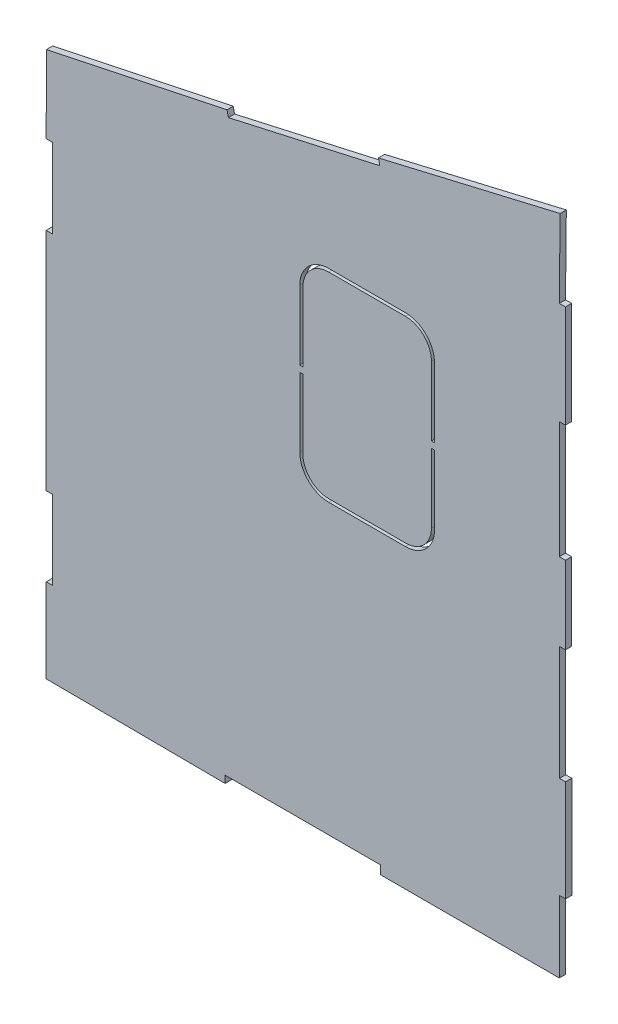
ISO-10303-21;
HEADER;
FILE_DESCRIPTION(('STEP AP214'),'2;1');
FILE_NAME('part.step','',(''),(''),'','','');
FILE_SCHEMA(('AUTOMOTIVE_DESIGN { 1 0 10303 214 1 1 1 1 }'));
ENDSEC;
DATA;
#1=APPLICATION_CONTEXT('core data for automotive mechanical design processes');
#2=APPLICATION_PROTOCOL_DEFINITION('international standard','automotive_design',2000,#1);
#3=PRODUCT_CONTEXT('',#1,'mechanical');
#4=PRODUCT('Part','Part','',(#3));
#5=PRODUCT_RELATED_PRODUCT_CATEGORY('part','',(#4));
#6=PRODUCT_DEFINITION_FORMATION('','',#4);
#7=PRODUCT_DEFINITION_CONTEXT('part definition',#1,'design');
#8=PRODUCT_DEFINITION('design','',#6,#7);
#9=PRODUCT_DEFINITION_SHAPE('','',#8);
#10=(LENGTH_UNIT() NAMED_UNIT(*) SI_UNIT(.MILLI.,.METRE.));
#11=(NAMED_UNIT(*) PLANE_ANGLE_UNIT() SI_UNIT($,.RADIAN.));
#12=(NAMED_UNIT(*) SI_UNIT($,.STERADIAN.) SOLID_ANGLE_UNIT());
#13=UNCERTAINTY_MEASURE_WITH_UNIT(LENGTH_MEASURE(1.E-05),#10,'distance_accuracy_value','');
#14=(GEOMETRIC_REPRESENTATION_CONTEXT(3) GLOBAL_UNCERTAINTY_ASSIGNED_CONTEXT((#13)) GLOBAL_UNIT_ASSIGNED_CONTEXT((#10,
#11,#12)) REPRESENTATION_CONTEXT('',''));
#15=CARTESIAN_POINT('',(0.,0.,0.));
#16=DIRECTION('',(0.,0.,1.));
#17=DIRECTION('',(1.,0.,0.));
#18=AXIS2_PLACEMENT_3D('',#15,#16,#17);
#19=CARTESIAN_POINT('',(53.4461294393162,83.145887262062,1.524));
#20=DIRECTION('',(0.206660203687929,-0.978412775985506,0.));
#21=DIRECTION('',(0.978412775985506,0.206660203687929,0.));
#22=AXIS2_PLACEMENT_3D('',#19,#20,#21);
#23=PLANE('',#22);
#24=DIRECTION('',(-0.978412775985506,-0.206660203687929,0.));
#25=VECTOR('',#24,1.);
#26=CARTESIAN_POINT('',(53.4461294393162,83.145887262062,0.));
#27=LINE('',#26,#25);
#28=CARTESIAN_POINT('',(53.4461294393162,83.145887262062,0.));
#29=VERTEX_POINT('',#28);
#30=CARTESIAN_POINT('',(9.09266780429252,73.7775555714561,0.));
#31=VERTEX_POINT('',#30);
#32=EDGE_CURVE('E562',#29,#31,#27,.T.);
#33=ORIENTED_EDGE('',*,*,#32,.T.);
#34=DIRECTION('',(0.,0.,-1.));
#35=VECTOR('',#34,1.);
#36=CARTESIAN_POINT('',(9.09266780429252,73.7775555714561,1.524));
#37=LINE('',#36,#35);
#38=CARTESIAN_POINT('',(9.09266780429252,73.7775555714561,1.524));
#39=VERTEX_POINT('',#38);
#40=EDGE_CURVE('E11',#39,#31,#37,.T.);
#41=ORIENTED_EDGE('',*,*,#40,.F.);
#42=DIRECTION('',(-0.978412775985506,-0.206660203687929,0.));
#43=VECTOR('',#42,1.);
#44=CARTESIAN_POINT('',(53.4461294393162,83.145887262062,1.524));
#45=LINE('',#44,#43);
#46=CARTESIAN_POINT('',(53.4461294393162,83.145887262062,1.524));
#47=VERTEX_POINT('',#46);
#48=EDGE_CURVE('E585',#47,#39,#45,.T.);
#49=ORIENTED_EDGE('',*,*,#48,.F.);
#50=DIRECTION('',(0.,0.,-1.));
#51=VECTOR('',#50,1.);
#52=CARTESIAN_POINT('',(53.4461294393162,83.145887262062,1.524));
#53=LINE('',#52,#51);
#54=EDGE_CURVE('E651',#47,#29,#53,.T.);
#55=ORIENTED_EDGE('',*,*,#54,.T.);
#56=EDGE_LOOP('',(#33,#41,#49,#55));
#57=FACE_BOUND('',#56,.T.);
#58=ADVANCED_FACE('F36',(#57),#23,.F.);
#59=CARTESIAN_POINT('',(9.09266780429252,73.7775555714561,1.524));
#60=DIRECTION('',(0.999996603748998,-0.00260624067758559,0.));
#61=DIRECTION('',(0.00260624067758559,0.999996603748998,0.));
#62=AXIS2_PLACEMENT_3D('',#59,#60,#61);
#63=PLANE('',#62);
#64=DIRECTION('',(-0.00260624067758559,-0.999996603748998,0.));
#65=VECTOR('',#64,1.);
#66=CARTESIAN_POINT('',(9.09266780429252,73.7775555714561,0.));
#67=LINE('',#66,#65);
#68=CARTESIAN_POINT('',(9.04322276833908,54.8058357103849,0.));
#69=VERTEX_POINT('',#68);
#70=EDGE_CURVE('E654',#31,#69,#67,.T.);
#71=ORIENTED_EDGE('',*,*,#70,.T.);
#72=DIRECTION('',(0.,0.,-1.));
#73=VECTOR('',#72,1.);
#74=CARTESIAN_POINT('',(9.04322276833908,54.8058357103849,1.524));
#75=LINE('',#74,#73);
#76=CARTESIAN_POINT('',(9.04322276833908,54.8058357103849,1.524));
#77=VERTEX_POINT('',#76);
#78=EDGE_CURVE('E43',#77,#69,#75,.T.);
#79=ORIENTED_EDGE('',*,*,#78,.F.);
#80=DIRECTION('',(-0.00260624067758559,-0.999996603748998,0.));
#81=VECTOR('',#80,1.);
#82=CARTESIAN_POINT('',(9.09266780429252,73.7775555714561,1.524));
#83=LINE('',#82,#81);
#84=EDGE_CURVE('E588',#39,#77,#83,.T.);
#85=ORIENTED_EDGE('',*,*,#84,.F.);
#86=ORIENTED_EDGE('',*,*,#40,.T.);
#87=EDGE_LOOP('',(#71,#79,#85,#86));
#88=FACE_BOUND('',#87,.T.);
#89=ADVANCED_FACE('F830',(#88),#63,.F.);
#90=CARTESIAN_POINT('',(9.04322276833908,54.8058357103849,1.524));
#91=DIRECTION('',(0.,1.,0.));
#92=DIRECTION('',(0.,0.,1.));
#93=AXIS2_PLACEMENT_3D('',#90,#91,#92);
#94=PLANE('',#93);
#95=DIRECTION('',(1.,0.,0.));
#96=VECTOR('',#95,1.);
#97=CARTESIAN_POINT('',(9.04322276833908,54.8058357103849,0.));
#98=LINE('',#97,#96);
#99=CARTESIAN_POINT('',(10.6040516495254,54.8058357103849,0.));
#100=VERTEX_POINT('',#99);
#101=EDGE_CURVE('E656',#69,#100,#98,.T.);
#102=ORIENTED_EDGE('',*,*,#101,.T.);
#103=DIRECTION('',(0.,0.,-1.));
#104=VECTOR('',#103,1.);
#105=CARTESIAN_POINT('',(10.6040516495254,54.8058357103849,1.524));
#106=LINE('',#105,#104);
#107=CARTESIAN_POINT('',(10.6040516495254,54.8058357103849,1.524));
#108=VERTEX_POINT('',#107);
#109=EDGE_CURVE('E801',#108,#100,#106,.T.);
#110=ORIENTED_EDGE('',*,*,#109,.F.);
#111=DIRECTION('',(1.,0.,0.));
#112=VECTOR('',#111,1.);
#113=CARTESIAN_POINT('',(9.04322276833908,54.8058357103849,1.524));
#114=LINE('',#113,#112);
#115=EDGE_CURVE('E591',#77,#108,#114,.T.);
#116=ORIENTED_EDGE('',*,*,#115,.F.);
#117=ORIENTED_EDGE('',*,*,#78,.T.);
#118=EDGE_LOOP('',(#102,#110,#116,#117));
#119=FACE_BOUND('',#118,.T.);
#120=ADVANCED_FACE('F808',(#119),#94,.F.);
#121=CARTESIAN_POINT('',(10.6040516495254,54.8058357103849,1.524));
#122=DIRECTION('',(0.999997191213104,-0.00237014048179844,0.));
#123=DIRECTION('',(0.00237014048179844,0.999997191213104,0.));
#124=AXIS2_PLACEMENT_3D('',#121,#122,#123);
#125=PLANE('',#124);
#126=DIRECTION('',(-0.00237014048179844,-0.999997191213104,0.));
#127=VECTOR('',#126,1.);
#128=CARTESIAN_POINT('',(10.6040516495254,54.8058357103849,0.));
#129=LINE('',#128,#127);
#130=CARTESIAN_POINT('',(10.5578453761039,35.3107281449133,0.));
#131=VERTEX_POINT('',#130);
#132=EDGE_CURVE('E658',#100,#131,#129,.T.);
#133=ORIENTED_EDGE('',*,*,#132,.T.);
#134=DIRECTION('',(0.,0.,-1.));
#135=VECTOR('',#134,1.);
#136=CARTESIAN_POINT('',(10.5578453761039,35.3107281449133,1.524));
#137=LINE('',#136,#135);
#138=CARTESIAN_POINT('',(10.5578453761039,35.3107281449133,1.524));
#139=VERTEX_POINT('',#138);
#140=EDGE_CURVE('E798',#139,#131,#137,.T.);
#141=ORIENTED_EDGE('',*,*,#140,.F.);
#142=DIRECTION('',(-0.00237014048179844,-0.999997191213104,0.));
#143=VECTOR('',#142,1.);
#144=CARTESIAN_POINT('',(10.6040516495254,54.8058357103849,1.524));
#145=LINE('',#144,#143);
#146=EDGE_CURVE('E593',#108,#139,#145,.T.);
#147=ORIENTED_EDGE('',*,*,#146,.F.);
#148=ORIENTED_EDGE('',*,*,#109,.T.);
#149=EDGE_LOOP('',(#133,#141,#147,#148));
#150=FACE_BOUND('',#149,.T.);
#151=ADVANCED_FACE('F818',(#150),#125,.F.);
#152=CARTESIAN_POINT('',(10.5578453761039,35.3107281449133,1.524));
#153=DIRECTION('',(0.,-1.,0.));
#154=DIRECTION('',(0.,0.,-1.));
#155=AXIS2_PLACEMENT_3D('',#152,#153,#154);
#156=PLANE('',#155);
#157=DIRECTION('',(-1.,0.,0.));
#158=VECTOR('',#157,1.);
#159=CARTESIAN_POINT('',(10.5578453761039,35.3107281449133,0.));
#160=LINE('',#159,#158);
#161=CARTESIAN_POINT('',(9.04322276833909,35.3107281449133,0.));
#162=VERTEX_POINT('',#161);
#163=EDGE_CURVE('E660',#131,#162,#160,.T.);
#164=ORIENTED_EDGE('',*,*,#163,.T.);
#165=DIRECTION('',(0.,0.,-1.));
#166=VECTOR('',#165,1.);
#167=CARTESIAN_POINT('',(9.04322276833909,35.3107281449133,1.524));
#168=LINE('',#167,#166);
#169=CARTESIAN_POINT('',(9.04322276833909,35.3107281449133,1.524));
#170=VERTEX_POINT('',#169);
#171=EDGE_CURVE('E795',#170,#162,#168,.T.);
#172=ORIENTED_EDGE('',*,*,#171,.F.);
#173=DIRECTION('',(-1.,0.,0.));
#174=VECTOR('',#173,1.);
#175=CARTESIAN_POINT('',(10.5578453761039,35.3107281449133,1.524));
#176=LINE('',#175,#174);
#177=EDGE_CURVE('E595',#139,#170,#176,.T.);
#178=ORIENTED_EDGE('',*,*,#177,.F.);
#179=ORIENTED_EDGE('',*,*,#140,.T.);
#180=EDGE_LOOP('',(#164,#172,#178,#179));
#181=FACE_BOUND('',#180,.T.);
#182=ADVANCED_FACE('F822',(#181),#156,.F.);
#183=CARTESIAN_POINT('',(9.04322276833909,35.3107281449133,1.524));
#184=DIRECTION('',(1.,0.,0.));
#185=DIRECTION('',(0.,0.,-1.));
#186=AXIS2_PLACEMENT_3D('',#183,#184,#185);
#187=PLANE('',#186);
#188=DIRECTION('',(0.,-1.,0.));
#189=VECTOR('',#188,1.);
#190=CARTESIAN_POINT('',(9.04322276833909,35.3107281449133,0.));
#191=LINE('',#190,#189);
#192=CARTESIAN_POINT('',(9.04322276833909,-20.0520327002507,0.));
#193=VERTEX_POINT('',#192);
#194=EDGE_CURVE('E662',#162,#193,#191,.T.);
#195=ORIENTED_EDGE('',*,*,#194,.T.);
#196=DIRECTION('',(0.,0.,-1.));
#197=VECTOR('',#196,1.);
#198=CARTESIAN_POINT('',(9.04322276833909,-20.0520327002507,1.524));
#199=LINE('',#198,#197);
#200=CARTESIAN_POINT('',(9.04322276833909,-20.0520327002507,1.524));
#201=VERTEX_POINT('',#200);
#202=EDGE_CURVE('E792',#201,#193,#199,.T.);
#203=ORIENTED_EDGE('',*,*,#202,.F.);
#204=DIRECTION('',(0.,-1.,0.));
#205=VECTOR('',#204,1.);
#206=CARTESIAN_POINT('',(9.04322276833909,35.3107281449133,1.524));
#207=LINE('',#206,#205);
#208=EDGE_CURVE('E597',#170,#201,#207,.T.);
#209=ORIENTED_EDGE('',*,*,#208,.F.);
#210=ORIENTED_EDGE('',*,*,#171,.T.);
#211=EDGE_LOOP('',(#195,#203,#209,#210));
#212=FACE_BOUND('',#211,.T.);
#213=ADVANCED_FACE('F963',(#212),#187,.F.);
#214=CARTESIAN_POINT('',(9.04322276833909,-20.0520327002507,1.524));
#215=DIRECTION('',(-0.00641781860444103,0.999979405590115,0.));
#216=DIRECTION('',(-0.999979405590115,-0.00641781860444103,0.));
#217=AXIS2_PLACEMENT_3D('',#214,#215,#216);
#218=PLANE('',#217);
#219=DIRECTION('',(0.999979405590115,0.00641781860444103,0.));
#220=VECTOR('',#219,1.);
#221=CARTESIAN_POINT('',(9.04322276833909,-20.0520327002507,0.));
#222=LINE('',#221,#220);
#223=CARTESIAN_POINT('',(10.6018734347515,-20.042029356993,0.));
#224=VERTEX_POINT('',#223);
#225=EDGE_CURVE('E664',#193,#224,#222,.T.);
#226=ORIENTED_EDGE('',*,*,#225,.T.);
#227=DIRECTION('',(0.,0.,-1.));
#228=VECTOR('',#227,1.);
#229=CARTESIAN_POINT('',(10.6018734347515,-20.042029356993,1.524));
#230=LINE('',#229,#228);
#231=CARTESIAN_POINT('',(10.6018734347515,-20.042029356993,1.524));
#232=VERTEX_POINT('',#231);
#233=EDGE_CURVE('E789',#232,#224,#230,.T.);
#234=ORIENTED_EDGE('',*,*,#233,.F.);
#235=DIRECTION('',(0.999979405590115,0.00641781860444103,0.));
#236=VECTOR('',#235,1.);
#237=CARTESIAN_POINT('',(9.04322276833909,-20.0520327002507,1.524));
#238=LINE('',#237,#236);
#239=EDGE_CURVE('E599',#201,#232,#238,.T.);
#240=ORIENTED_EDGE('',*,*,#239,.F.);
#241=ORIENTED_EDGE('',*,*,#202,.T.);
#242=EDGE_LOOP('',(#226,#234,#240,#241));
#243=FACE_BOUND('',#242,.T.);
#244=ADVANCED_FACE('F961',(#243),#218,.F.);
#245=CARTESIAN_POINT('',(10.6018734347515,-20.042029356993,1.524));
#246=DIRECTION('',(1.,0.,0.));
#247=DIRECTION('',(0.,0.,-1.));
#248=AXIS2_PLACEMENT_3D('',#245,#246,#247);
#249=PLANE('',#248);
#250=DIRECTION('',(0.,-1.,0.));
#251=VECTOR('',#250,1.);
#252=CARTESIAN_POINT('',(10.6018734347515,-20.042029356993,0.));
#253=LINE('',#252,#251);
#254=CARTESIAN_POINT('',(10.6018734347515,-39.4165262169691,0.));
#255=VERTEX_POINT('',#254);
#256=EDGE_CURVE('E666',#224,#255,#253,.T.);
#257=ORIENTED_EDGE('',*,*,#256,.T.);
#258=DIRECTION('',(0.,0.,-1.));
#259=VECTOR('',#258,1.);
#260=CARTESIAN_POINT('',(10.6018734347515,-39.4165262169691,1.524));
#261=LINE('',#260,#259);
#262=CARTESIAN_POINT('',(10.6018734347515,-39.4165262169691,1.524));
#263=VERTEX_POINT('',#262);
#264=EDGE_CURVE('E786',#263,#255,#261,.T.);
#265=ORIENTED_EDGE('',*,*,#264,.F.);
#266=DIRECTION('',(0.,-1.,0.));
#267=VECTOR('',#266,1.);
#268=CARTESIAN_POINT('',(10.6018734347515,-20.042029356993,1.524));
#269=LINE('',#268,#267);
#270=EDGE_CURVE('E601',#232,#263,#269,.T.);
#271=ORIENTED_EDGE('',*,*,#270,.F.);
#272=ORIENTED_EDGE('',*,*,#233,.T.);
#273=EDGE_LOOP('',(#257,#265,#271,#272));
#274=FACE_BOUND('',#273,.T.);
#275=ADVANCED_FACE('F956',(#274),#249,.F.);
#276=CARTESIAN_POINT('',(10.6018734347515,-39.4165262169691,1.524));
#277=DIRECTION('',(0.,-1.,0.));
#278=DIRECTION('',(0.,0.,-1.));
#279=AXIS2_PLACEMENT_3D('',#276,#277,#278);
#280=PLANE('',#279);
#281=DIRECTION('',(-1.,0.,0.));
#282=VECTOR('',#281,1.);
#283=CARTESIAN_POINT('',(10.6018734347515,-39.4165262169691,0.));
#284=LINE('',#283,#282);
#285=CARTESIAN_POINT('',(9.04322276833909,-39.4165262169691,0.));
#286=VERTEX_POINT('',#285);
#287=EDGE_CURVE('E668',#255,#286,#284,.T.);
#288=ORIENTED_EDGE('',*,*,#287,.T.);
#289=DIRECTION('',(0.,0.,-1.));
#290=VECTOR('',#289,1.);
#291=CARTESIAN_POINT('',(9.04322276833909,-39.4165262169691,1.524));
#292=LINE('',#291,#290);
#293=CARTESIAN_POINT('',(9.04322276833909,-39.4165262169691,1.524));
#294=VERTEX_POINT('',#293);
#295=EDGE_CURVE('E783',#294,#286,#292,.T.);
#296=ORIENTED_EDGE('',*,*,#295,.F.);
#297=DIRECTION('',(-1.,0.,0.));
#298=VECTOR('',#297,1.);
#299=CARTESIAN_POINT('',(10.6018734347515,-39.4165262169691,1.524));
#300=LINE('',#299,#298);
#301=EDGE_CURVE('E603',#263,#294,#300,.T.);
#302=ORIENTED_EDGE('',*,*,#301,.F.);
#303=ORIENTED_EDGE('',*,*,#264,.T.);
#304=EDGE_LOOP('',(#288,#296,#302,#303));
#305=FACE_BOUND('',#304,.T.);
#306=ADVANCED_FACE('F951',(#305),#280,.F.);
#307=CARTESIAN_POINT('',(9.04322276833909,-39.4165262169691,1.524));
#308=DIRECTION('',(0.999999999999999,-3.54413380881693E-08,0.));
#309=DIRECTION('',(3.54413380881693E-08,1.,0.));
#310=AXIS2_PLACEMENT_3D('',#307,#308,#309);
#311=PLANE('',#310);
#312=DIRECTION('',(-3.54413380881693E-08,-0.999999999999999,0.));
#313=VECTOR('',#312,1.);
#314=CARTESIAN_POINT('',(9.04322276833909,-39.4165262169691,0.));
#315=LINE('',#314,#313);
#316=CARTESIAN_POINT('',(9.04322203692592,-60.0538159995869,0.));
#317=VERTEX_POINT('',#316);
#318=EDGE_CURVE('E670',#286,#317,#315,.T.);
#319=ORIENTED_EDGE('',*,*,#318,.T.);
#320=DIRECTION('',(0.,0.,-1.));
#321=VECTOR('',#320,1.);
#322=CARTESIAN_POINT('',(9.04322203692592,-60.0538159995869,1.524));
#323=LINE('',#322,#321);
#324=CARTESIAN_POINT('',(9.04322203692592,-60.0538159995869,1.524));
#325=VERTEX_POINT('',#324);
#326=EDGE_CURVE('E780',#325,#317,#323,.T.);
#327=ORIENTED_EDGE('',*,*,#326,.F.);
#328=DIRECTION('',(-3.54413380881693E-08,-0.999999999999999,0.));
#329=VECTOR('',#328,1.);
#330=CARTESIAN_POINT('',(9.04322276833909,-39.4165262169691,1.524));
#331=LINE('',#330,#329);
#332=EDGE_CURVE('E605',#294,#325,#331,.T.);
#333=ORIENTED_EDGE('',*,*,#332,.F.);
#334=ORIENTED_EDGE('',*,*,#295,.T.);
#335=EDGE_LOOP('',(#319,#327,#333,#334));
#336=FACE_BOUND('',#335,.T.);
#337=ADVANCED_FACE('F947',(#336),#311,.F.);
#338=CARTESIAN_POINT('',(9.04322203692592,-60.0538159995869,1.524));
#339=DIRECTION('',(0.00616886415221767,0.99998097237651,0.));
#340=DIRECTION('',(-0.999980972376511,0.00616886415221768,0.));
#341=AXIS2_PLACEMENT_3D('',#338,#339,#340);
#342=PLANE('',#341);
#343=DIRECTION('',(0.999980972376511,-0.00616886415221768,0.));
#344=VECTOR('',#343,1.);
#345=CARTESIAN_POINT('',(9.04322203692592,-60.0538159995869,0.));
#346=LINE('',#345,#344);
#347=CARTESIAN_POINT('',(52.9847421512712,-60.3248904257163,0.));
#348=VERTEX_POINT('',#347);
#349=EDGE_CURVE('E672',#317,#348,#346,.T.);
#350=ORIENTED_EDGE('',*,*,#349,.T.);
#351=DIRECTION('',(0.,0.,-1.));
#352=VECTOR('',#351,1.);
#353=CARTESIAN_POINT('',(52.9847421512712,-60.3248904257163,1.524));
#354=LINE('',#353,#352);
#355=CARTESIAN_POINT('',(52.9847421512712,-60.3248904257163,1.524));
#356=VERTEX_POINT('',#355);
#357=EDGE_CURVE('E777',#356,#348,#354,.T.);
#358=ORIENTED_EDGE('',*,*,#357,.F.);
#359=DIRECTION('',(0.999980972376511,-0.00616886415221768,0.));
#360=VECTOR('',#359,1.);
#361=CARTESIAN_POINT('',(9.04322203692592,-60.0538159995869,1.524));
#362=LINE('',#361,#360);
#363=EDGE_CURVE('E607',#325,#356,#362,.T.);
#364=ORIENTED_EDGE('',*,*,#363,.F.);
#365=ORIENTED_EDGE('',*,*,#326,.T.);
#366=EDGE_LOOP('',(#350,#358,#364,#365));
#367=FACE_BOUND('',#366,.T.);
#368=ADVANCED_FACE('F942',(#367),#342,.F.);
#369=CARTESIAN_POINT('',(52.9847421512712,-60.3248904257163,1.524));
#370=DIRECTION('',(-0.999999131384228,-0.00131804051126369,0.));
#371=DIRECTION('',(0.00131804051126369,-0.999999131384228,0.));
#372=AXIS2_PLACEMENT_3D('',#369,#370,#371);
#373=PLANE('',#372);
#374=DIRECTION('',(-0.00131804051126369,0.999999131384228,0.));
#375=VECTOR('',#374,1.);
#376=CARTESIAN_POINT('',(52.9847421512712,-60.3248904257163,0.));
#377=LINE('',#376,#375);
#378=CARTESIAN_POINT('',(52.9824237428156,-58.5659107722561,0.));
#379=VERTEX_POINT('',#378);
#380=EDGE_CURVE('E674',#348,#379,#377,.T.);
#381=ORIENTED_EDGE('',*,*,#380,.T.);
#382=DIRECTION('',(0.,0.,-1.));
#383=VECTOR('',#382,1.);
#384=CARTESIAN_POINT('',(52.9824237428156,-58.5659107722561,1.524));
#385=LINE('',#384,#383);
#386=CARTESIAN_POINT('',(52.9824237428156,-58.5659107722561,1.524));
#387=VERTEX_POINT('',#386);
#388=EDGE_CURVE('E774',#387,#379,#385,.T.);
#389=ORIENTED_EDGE('',*,*,#388,.F.);
#390=DIRECTION('',(-0.00131804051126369,0.999999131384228,0.));
#391=VECTOR('',#390,1.);
#392=CARTESIAN_POINT('',(52.9847421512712,-60.3248904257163,1.524));
#393=LINE('',#392,#391);
#394=EDGE_CURVE('E609',#356,#387,#393,.T.);
#395=ORIENTED_EDGE('',*,*,#394,.F.);
#396=ORIENTED_EDGE('',*,*,#357,.T.);
#397=EDGE_LOOP('',(#381,#389,#395,#396));
#398=FACE_BOUND('',#397,.T.);
#399=ADVANCED_FACE('F936',(#398),#373,.F.);
#400=CARTESIAN_POINT('',(91.0824237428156,-58.5659107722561,1.524));
#401=DIRECTION('',(0.,1.,0.));
#402=DIRECTION('',(0.,0.,1.));
#403=AXIS2_PLACEMENT_3D('',#400,#401,#402);
#404=PLANE('',#403);
#405=DIRECTION('',(1.,0.,0.));
#406=VECTOR('',#405,1.);
#407=CARTESIAN_POINT('',(91.0824237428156,-58.5659107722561,0.));
#408=LINE('',#407,#406);
#409=CARTESIAN_POINT('',(91.0824237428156,-58.5659107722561,0.));
#410=VERTEX_POINT('',#409);
#411=EDGE_CURVE('E676',#379,#410,#408,.T.);
#412=ORIENTED_EDGE('',*,*,#411,.T.);
#413=DIRECTION('',(0.,0.,-1.));
#414=VECTOR('',#413,1.);
#415=CARTESIAN_POINT('',(91.0824237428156,-58.5659107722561,1.524));
#416=LINE('',#415,#414);
#417=CARTESIAN_POINT('',(91.0824237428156,-58.5659107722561,1.524));
#418=VERTEX_POINT('',#417);
#419=EDGE_CURVE('E771',#418,#410,#416,.T.);
#420=ORIENTED_EDGE('',*,*,#419,.F.);
#421=DIRECTION('',(1.,0.,0.));
#422=VECTOR('',#421,1.);
#423=CARTESIAN_POINT('',(91.0824237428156,-58.5659107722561,1.524));
#424=LINE('',#423,#422);
#425=EDGE_CURVE('E611',#387,#418,#424,.T.);
#426=ORIENTED_EDGE('',*,*,#425,.F.);
#427=ORIENTED_EDGE('',*,*,#388,.T.);
#428=EDGE_LOOP('',(#412,#420,#426,#427));
#429=FACE_BOUND('',#428,.T.);
#430=ADVANCED_FACE('F932',(#429),#404,.F.);
#431=CARTESIAN_POINT('',(91.0824237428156,-60.6710740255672,1.524));
#432=DIRECTION('',(1.,0.,0.));
#433=DIRECTION('',(0.,0.,-1.));
#434=AXIS2_PLACEMENT_3D('',#431,#432,#433);
#435=PLANE('',#434);
#436=DIRECTION('',(0.,-1.,0.));
#437=VECTOR('',#436,1.);
#438=CARTESIAN_POINT('',(91.0824237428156,-60.6710740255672,0.));
#439=LINE('',#438,#437);
#440=CARTESIAN_POINT('',(91.0824237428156,-60.6710740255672,0.));
#441=VERTEX_POINT('',#440);
#442=EDGE_CURVE('E678',#410,#441,#439,.T.);
#443=ORIENTED_EDGE('',*,*,#442,.T.);
#444=DIRECTION('',(0.,0.,-1.));
#445=VECTOR('',#444,1.);
#446=CARTESIAN_POINT('',(91.0824237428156,-60.6710740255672,1.524));
#447=LINE('',#446,#445);
#448=CARTESIAN_POINT('',(91.0824237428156,-60.6710740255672,1.524));
#449=VERTEX_POINT('',#448);
#450=EDGE_CURVE('E768',#449,#441,#447,.T.);
#451=ORIENTED_EDGE('',*,*,#450,.F.);
#452=DIRECTION('',(0.,-1.,0.));
#453=VECTOR('',#452,1.);
#454=CARTESIAN_POINT('',(91.0824237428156,-60.6710740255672,1.524));
#455=LINE('',#454,#453);
#456=EDGE_CURVE('E613',#418,#449,#455,.T.);
#457=ORIENTED_EDGE('',*,*,#456,.F.);
#458=ORIENTED_EDGE('',*,*,#419,.T.);
#459=EDGE_LOOP('',(#443,#451,#457,#458));
#460=FACE_BOUND('',#459,.T.);
#461=ADVANCED_FACE('F927',(#460),#435,.F.);
#462=CARTESIAN_POINT('',(91.0824237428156,-60.6710740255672,1.524));
#463=DIRECTION('',(0.,1.,0.));
#464=DIRECTION('',(0.,0.,1.));
#465=AXIS2_PLACEMENT_3D('',#462,#463,#464);
#466=PLANE('',#465);
#467=DIRECTION('',(1.,0.,0.));
#468=VECTOR('',#467,1.);
#469=CARTESIAN_POINT('',(91.0824237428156,-60.6710740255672,0.));
#470=LINE('',#469,#468);
#471=CARTESIAN_POINT('',(135.021624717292,-60.6710740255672,0.));
#472=VERTEX_POINT('',#471);
#473=EDGE_CURVE('E680',#441,#472,#470,.T.);
#474=ORIENTED_EDGE('',*,*,#473,.T.);
#475=DIRECTION('',(0.,0.,-1.));
#476=VECTOR('',#475,1.);
#477=CARTESIAN_POINT('',(135.021624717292,-60.6710740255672,1.524));
#478=LINE('',#477,#476);
#479=CARTESIAN_POINT('',(135.021624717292,-60.6710740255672,1.524));
#480=VERTEX_POINT('',#479);
#481=EDGE_CURVE('E765',#480,#472,#478,.T.);
#482=ORIENTED_EDGE('',*,*,#481,.F.);
#483=DIRECTION('',(1.,0.,0.));
#484=VECTOR('',#483,1.);
#485=CARTESIAN_POINT('',(91.0824237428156,-60.6710740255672,1.524));
#486=LINE('',#485,#484);
#487=EDGE_CURVE('E615',#449,#480,#486,.T.);
#488=ORIENTED_EDGE('',*,*,#487,.F.);
#489=ORIENTED_EDGE('',*,*,#450,.T.);
#490=EDGE_LOOP('',(#474,#482,#488,#489));
#491=FACE_BOUND('',#490,.T.);
#492=ADVANCED_FACE('F921',(#491),#466,.F.);
#493=CARTESIAN_POINT('',(135.021624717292,-60.6710740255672,1.524));
#494=DIRECTION('',(-1.,0.,0.));
#495=DIRECTION('',(0.,0.,1.));
#496=AXIS2_PLACEMENT_3D('',#493,#494,#495);
#497=PLANE('',#496);
#498=DIRECTION('',(0.,1.,0.));
#499=VECTOR('',#498,1.);
#500=CARTESIAN_POINT('',(135.021624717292,-60.6710740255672,0.));
#501=LINE('',#500,#499);
#502=CARTESIAN_POINT('',(135.021624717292,-43.0804716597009,0.));
#503=VERTEX_POINT('',#502);
#504=EDGE_CURVE('E682',#472,#503,#501,.T.);
#505=ORIENTED_EDGE('',*,*,#504,.T.);
#506=DIRECTION('',(0.,0.,-1.));
#507=VECTOR('',#506,1.);
#508=CARTESIAN_POINT('',(135.021624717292,-43.0804716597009,1.524));
#509=LINE('',#508,#507);
#510=CARTESIAN_POINT('',(135.021624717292,-43.0804716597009,1.524));
#511=VERTEX_POINT('',#510);
#512=EDGE_CURVE('E762',#511,#503,#509,.T.);
#513=ORIENTED_EDGE('',*,*,#512,.F.);
#514=DIRECTION('',(0.,1.,0.));
#515=VECTOR('',#514,1.);
#516=CARTESIAN_POINT('',(135.021624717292,-60.6710740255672,1.524));
#517=LINE('',#516,#515);
#518=EDGE_CURVE('E617',#480,#511,#517,.T.);
#519=ORIENTED_EDGE('',*,*,#518,.F.);
#520=ORIENTED_EDGE('',*,*,#481,.T.);
#521=EDGE_LOOP('',(#505,#513,#519,#520));
#522=FACE_BOUND('',#521,.T.);
#523=ADVANCED_FACE('F917',(#522),#497,.F.);
#524=CARTESIAN_POINT('',(135.021624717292,-43.0804716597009,1.524));
#525=DIRECTION('',(0.,1.,0.));
#526=DIRECTION('',(0.,0.,1.));
#527=AXIS2_PLACEMENT_3D('',#524,#525,#526);
#528=PLANE('',#527);
#529=DIRECTION('',(1.,0.,0.));
#530=VECTOR('',#529,1.);
#531=CARTESIAN_POINT('',(135.021624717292,-43.0804716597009,0.));
#532=LINE('',#531,#530);
#533=CARTESIAN_POINT('',(136.57367180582,-43.0804716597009,0.));
#534=VERTEX_POINT('',#533);
#535=EDGE_CURVE('E684',#503,#534,#532,.T.);
#536=ORIENTED_EDGE('',*,*,#535,.T.);
#537=DIRECTION('',(0.,0.,-1.));
#538=VECTOR('',#537,1.);
#539=CARTESIAN_POINT('',(136.57367180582,-43.0804716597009,1.524));
#540=LINE('',#539,#538);
#541=CARTESIAN_POINT('',(136.57367180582,-43.0804716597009,1.524));
#542=VERTEX_POINT('',#541);
#543=EDGE_CURVE('E759',#542,#534,#540,.T.);
#544=ORIENTED_EDGE('',*,*,#543,.F.);
#545=DIRECTION('',(1.,0.,0.));
#546=VECTOR('',#545,1.);
#547=CARTESIAN_POINT('',(135.021624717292,-43.0804716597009,1.524));
#548=LINE('',#547,#546);
#549=EDGE_CURVE('E619',#511,#542,#548,.T.);
#550=ORIENTED_EDGE('',*,*,#549,.F.);
#551=ORIENTED_EDGE('',*,*,#512,.T.);
#552=EDGE_LOOP('',(#536,#544,#550,#551));
#553=FACE_BOUND('',#552,.T.);
#554=ADVANCED_FACE('F912',(#553),#528,.F.);
#555=CARTESIAN_POINT('',(136.57367180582,-43.0804716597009,1.524));
#556=DIRECTION('',(-1.,0.,0.));
#557=DIRECTION('',(0.,0.,1.));
#558=AXIS2_PLACEMENT_3D('',#555,#556,#557);
#559=PLANE('',#558);
#560=DIRECTION('',(0.,1.,0.));
#561=VECTOR('',#560,1.);
#562=CARTESIAN_POINT('',(136.57367180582,-43.0804716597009,0.));
#563=LINE('',#562,#561);
#564=CARTESIAN_POINT('',(136.57367180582,-18.1637867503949,0.));
#565=VERTEX_POINT('',#564);
#566=EDGE_CURVE('E686',#534,#565,#563,.T.);
#567=ORIENTED_EDGE('',*,*,#566,.T.);
#568=DIRECTION('',(0.,0.,-1.));
#569=VECTOR('',#568,1.);
#570=CARTESIAN_POINT('',(136.57367180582,-18.1637867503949,1.524));
#571=LINE('',#570,#569);
#572=CARTESIAN_POINT('',(136.57367180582,-18.1637867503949,1.524));
#573=VERTEX_POINT('',#572);
#574=EDGE_CURVE('E756',#573,#565,#571,.T.);
#575=ORIENTED_EDGE('',*,*,#574,.F.);
#576=DIRECTION('',(0.,1.,0.));
#577=VECTOR('',#576,1.);
#578=CARTESIAN_POINT('',(136.57367180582,-43.0804716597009,1.524));
#579=LINE('',#578,#577);
#580=EDGE_CURVE('E621',#542,#573,#579,.T.);
#581=ORIENTED_EDGE('',*,*,#580,.F.);
#582=ORIENTED_EDGE('',*,*,#543,.T.);
#583=EDGE_LOOP('',(#567,#575,#581,#582));
#584=FACE_BOUND('',#583,.T.);
#585=ADVANCED_FACE('F906',(#584),#559,.F.);
#586=CARTESIAN_POINT('',(136.57367180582,-18.1637867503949,1.524));
#587=DIRECTION('',(0.0422015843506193,-0.999109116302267,0.));
#588=DIRECTION('',(0.999109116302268,0.0422015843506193,0.));
#589=AXIS2_PLACEMENT_3D('',#586,#587,#588);
#590=PLANE('',#589);
#591=DIRECTION('',(-0.999109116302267,-0.0422015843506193,0.));
#592=VECTOR('',#591,1.);
#593=CARTESIAN_POINT('',(136.57367180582,-18.1637867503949,0.));
#594=LINE('',#593,#592);
#595=CARTESIAN_POINT('',(135.020697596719,-18.2293831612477,0.));
#596=VERTEX_POINT('',#595);
#597=EDGE_CURVE('E688',#565,#596,#594,.T.);
#598=ORIENTED_EDGE('',*,*,#597,.T.);
#599=DIRECTION('',(0.,0.,-1.));
#600=VECTOR('',#599,1.);
#601=CARTESIAN_POINT('',(135.020697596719,-18.2293831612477,1.524));
#602=LINE('',#601,#600);
#603=CARTESIAN_POINT('',(135.020697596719,-18.2293831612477,1.524));
#604=VERTEX_POINT('',#603);
#605=EDGE_CURVE('E753',#604,#596,#602,.T.);
#606=ORIENTED_EDGE('',*,*,#605,.F.);
#607=DIRECTION('',(-0.999109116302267,-0.0422015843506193,0.));
#608=VECTOR('',#607,1.);
#609=CARTESIAN_POINT('',(136.57367180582,-18.1637867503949,1.524));
#610=LINE('',#609,#608);
#611=EDGE_CURVE('E623',#573,#604,#610,.T.);
#612=ORIENTED_EDGE('',*,*,#611,.F.);
#613=ORIENTED_EDGE('',*,*,#574,.T.);
#614=EDGE_LOOP('',(#598,#606,#612,#613));
#615=FACE_BOUND('',#614,.T.);
#616=ADVANCED_FACE('F902',(#615),#590,.F.);
#617=CARTESIAN_POINT('',(135.020697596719,-18.2293831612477,1.524));
#618=DIRECTION('',(-1.,0.,0.));
#619=DIRECTION('',(0.,0.,1.));
#620=AXIS2_PLACEMENT_3D('',#617,#618,#619);
#621=PLANE('',#620);
#622=DIRECTION('',(0.,1.,0.));
#623=VECTOR('',#622,1.);
#624=CARTESIAN_POINT('',(135.020697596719,-18.2293831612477,0.));
#625=LINE('',#624,#623);
#626=CARTESIAN_POINT('',(135.020697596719,9.85836505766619,0.));
#627=VERTEX_POINT('',#626);
#628=EDGE_CURVE('E690',#596,#627,#625,.T.);
#629=ORIENTED_EDGE('',*,*,#628,.T.);
#630=DIRECTION('',(0.,0.,-1.));
#631=VECTOR('',#630,1.);
#632=CARTESIAN_POINT('',(135.020697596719,9.85836505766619,1.524));
#633=LINE('',#632,#631);
#634=CARTESIAN_POINT('',(135.020697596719,9.85836505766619,1.524));
#635=VERTEX_POINT('',#634);
#636=EDGE_CURVE('E750',#635,#627,#633,.T.);
#637=ORIENTED_EDGE('',*,*,#636,.F.);
#638=DIRECTION('',(0.,1.,0.));
#639=VECTOR('',#638,1.);
#640=CARTESIAN_POINT('',(135.020697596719,-18.2293831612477,1.524));
#641=LINE('',#640,#639);
#642=EDGE_CURVE('E625',#604,#635,#641,.T.);
#643=ORIENTED_EDGE('',*,*,#642,.F.);
#644=ORIENTED_EDGE('',*,*,#605,.T.);
#645=EDGE_LOOP('',(#629,#637,#643,#644));
#646=FACE_BOUND('',#645,.T.);
#647=ADVANCED_FACE('F897',(#646),#621,.F.);
#648=CARTESIAN_POINT('',(135.020697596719,9.85836505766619,1.524));
#649=DIRECTION('',(0.,1.,0.));
#650=DIRECTION('',(0.,0.,1.));
#651=AXIS2_PLACEMENT_3D('',#648,#649,#650);
#652=PLANE('',#651);
#653=DIRECTION('',(1.,0.,0.));
#654=VECTOR('',#653,1.);
#655=CARTESIAN_POINT('',(135.020697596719,9.85836505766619,0.));
#656=LINE('',#655,#654);
#657=CARTESIAN_POINT('',(136.544697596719,9.85836505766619,0.));
#658=VERTEX_POINT('',#657);
#659=EDGE_CURVE('E692',#627,#658,#656,.T.);
#660=ORIENTED_EDGE('',*,*,#659,.T.);
#661=DIRECTION('',(0.,0.,-1.));
#662=VECTOR('',#661,1.);
#663=CARTESIAN_POINT('',(136.544697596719,9.85836505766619,1.524));
#664=LINE('',#663,#662);
#665=CARTESIAN_POINT('',(136.544697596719,9.85836505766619,1.524));
#666=VERTEX_POINT('',#665);
#667=EDGE_CURVE('E747',#666,#658,#664,.T.);
#668=ORIENTED_EDGE('',*,*,#667,.F.);
#669=DIRECTION('',(1.,0.,0.));
#670=VECTOR('',#669,1.);
#671=CARTESIAN_POINT('',(135.020697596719,9.85836505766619,1.524));
#672=LINE('',#671,#670);
#673=EDGE_CURVE('E627',#635,#666,#672,.T.);
#674=ORIENTED_EDGE('',*,*,#673,.F.);
#675=ORIENTED_EDGE('',*,*,#636,.T.);
#676=EDGE_LOOP('',(#660,#668,#674,#675));
#677=FACE_BOUND('',#676,.T.);
#678=ADVANCED_FACE('F891',(#677),#652,.F.);
#679=CARTESIAN_POINT('',(136.544697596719,28.9083650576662,1.524));
#680=DIRECTION('',(-1.,0.,0.));
#681=DIRECTION('',(0.,-1.,0.));
#682=AXIS2_PLACEMENT_3D('',#679,#680,#681);
#683=PLANE('',#682);
#684=DIRECTION('',(0.,1.,0.));
#685=VECTOR('',#684,1.);
#686=CARTESIAN_POINT('',(136.544697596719,28.9083650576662,0.));
#687=LINE('',#686,#685);
#688=CARTESIAN_POINT('',(136.544697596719,28.9083650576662,0.));
#689=VERTEX_POINT('',#688);
#690=EDGE_CURVE('E694',#658,#689,#687,.T.);
#691=ORIENTED_EDGE('',*,*,#690,.T.);
#692=DIRECTION('',(0.,0.,-1.));
#693=VECTOR('',#692,1.);
#694=CARTESIAN_POINT('',(136.544697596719,28.9083650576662,1.524));
#695=LINE('',#694,#693);
#696=CARTESIAN_POINT('',(136.544697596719,28.9083650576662,1.524));
#697=VERTEX_POINT('',#696);
#698=EDGE_CURVE('E744',#697,#689,#695,.T.);
#699=ORIENTED_EDGE('',*,*,#698,.F.);
#700=DIRECTION('',(0.,1.,0.));
#701=VECTOR('',#700,1.);
#702=CARTESIAN_POINT('',(136.544697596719,28.9083650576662,1.524));
#703=LINE('',#702,#701);
#704=EDGE_CURVE('E629',#666,#697,#703,.T.);
#705=ORIENTED_EDGE('',*,*,#704,.F.);
#706=ORIENTED_EDGE('',*,*,#667,.T.);
#707=EDGE_LOOP('',(#691,#699,#705,#706));
#708=FACE_BOUND('',#707,.T.);
#709=ADVANCED_FACE('F887',(#708),#683,.F.);
#710=CARTESIAN_POINT('',(135.020697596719,28.9083650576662,1.524));
#711=DIRECTION('',(0.,-1.,0.));
#712=DIRECTION('',(1.,0.,0.));
#713=AXIS2_PLACEMENT_3D('',#710,#711,#712);
#714=PLANE('',#713);
#715=DIRECTION('',(-1.,0.,0.));
#716=VECTOR('',#715,1.);
#717=CARTESIAN_POINT('',(135.020697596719,28.9083650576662,0.));
#718=LINE('',#717,#716);
#719=CARTESIAN_POINT('',(135.020697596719,28.9083650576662,0.));
#720=VERTEX_POINT('',#719);
#721=EDGE_CURVE('E696',#689,#720,#718,.T.);
#722=ORIENTED_EDGE('',*,*,#721,.T.);
#723=DIRECTION('',(0.,0.,-1.));
#724=VECTOR('',#723,1.);
#725=CARTESIAN_POINT('',(135.020697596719,28.9083650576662,1.524));
#726=LINE('',#725,#724);
#727=CARTESIAN_POINT('',(135.020697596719,28.9083650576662,1.524));
#728=VERTEX_POINT('',#727);
#729=EDGE_CURVE('E741',#728,#720,#726,.T.);
#730=ORIENTED_EDGE('',*,*,#729,.F.);
#731=DIRECTION('',(-1.,0.,0.));
#732=VECTOR('',#731,1.);
#733=CARTESIAN_POINT('',(135.020697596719,28.9083650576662,1.524));
#734=LINE('',#733,#732);
#735=EDGE_CURVE('E631',#697,#728,#734,.T.);
#736=ORIENTED_EDGE('',*,*,#735,.F.);
#737=ORIENTED_EDGE('',*,*,#698,.T.);
#738=EDGE_LOOP('',(#722,#730,#736,#737));
#739=FACE_BOUND('',#738,.T.);
#740=ADVANCED_FACE('F882',(#739),#714,.F.);
#741=CARTESIAN_POINT('',(135.020697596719,28.9083650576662,1.524));
#742=DIRECTION('',(-1.,0.,0.));
#743=DIRECTION('',(0.,0.,1.));
#744=AXIS2_PLACEMENT_3D('',#741,#742,#743);
#745=PLANE('',#744);
#746=DIRECTION('',(0.,1.,0.));
#747=VECTOR('',#746,1.);
#748=CARTESIAN_POINT('',(135.020697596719,28.9083650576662,0.));
#749=LINE('',#748,#747);
#750=CARTESIAN_POINT('',(135.020697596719,57.63260458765,0.));
#751=VERTEX_POINT('',#750);
#752=EDGE_CURVE('E698',#720,#751,#749,.T.);
#753=ORIENTED_EDGE('',*,*,#752,.T.);
#754=DIRECTION('',(0.,0.,-1.));
#755=VECTOR('',#754,1.);
#756=CARTESIAN_POINT('',(135.020697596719,57.63260458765,1.524));
#757=LINE('',#756,#755);
#758=CARTESIAN_POINT('',(135.020697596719,57.63260458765,1.524));
#759=VERTEX_POINT('',#758);
#760=EDGE_CURVE('E738',#759,#751,#757,.T.);
#761=ORIENTED_EDGE('',*,*,#760,.F.);
#762=DIRECTION('',(0.,1.,0.));
#763=VECTOR('',#762,1.);
#764=CARTESIAN_POINT('',(135.020697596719,28.9083650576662,1.524));
#765=LINE('',#764,#763);
#766=EDGE_CURVE('E633',#728,#759,#765,.T.);
#767=ORIENTED_EDGE('',*,*,#766,.F.);
#768=ORIENTED_EDGE('',*,*,#729,.T.);
#769=EDGE_LOOP('',(#753,#761,#767,#768));
#770=FACE_BOUND('',#769,.T.);
#771=ADVANCED_FACE('F876',(#770),#745,.F.);
#772=CARTESIAN_POINT('',(135.020697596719,57.63260458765,1.524));
#773=DIRECTION('',(-0.0143127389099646,0.99989756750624,0.));
#774=DIRECTION('',(-0.99989756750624,-0.0143127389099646,0.));
#775=AXIS2_PLACEMENT_3D('',#772,#773,#774);
#776=PLANE('',#775);
#777=DIRECTION('',(0.99989756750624,0.0143127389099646,0.));
#778=VECTOR('',#777,1.);
#779=CARTESIAN_POINT('',(135.020697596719,57.63260458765,0.));
#780=LINE('',#779,#778);
#781=CARTESIAN_POINT('',(136.545359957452,57.6544289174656,0.));
#782=VERTEX_POINT('',#781);
#783=EDGE_CURVE('E700',#751,#782,#780,.T.);
#784=ORIENTED_EDGE('',*,*,#783,.T.);
#785=DIRECTION('',(0.,0.,-1.));
#786=VECTOR('',#785,1.);
#787=CARTESIAN_POINT('',(136.545359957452,57.6544289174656,1.524));
#788=LINE('',#787,#786);
#789=CARTESIAN_POINT('',(136.545359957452,57.6544289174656,1.524));
#790=VERTEX_POINT('',#789);
#791=EDGE_CURVE('E735',#790,#782,#788,.T.);
#792=ORIENTED_EDGE('',*,*,#791,.F.);
#793=DIRECTION('',(0.99989756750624,0.0143127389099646,0.));
#794=VECTOR('',#793,1.);
#795=CARTESIAN_POINT('',(135.020697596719,57.63260458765,1.524));
#796=LINE('',#795,#794);
#797=EDGE_CURVE('E635',#759,#790,#796,.T.);
#798=ORIENTED_EDGE('',*,*,#797,.F.);
#799=ORIENTED_EDGE('',*,*,#760,.T.);
#800=EDGE_LOOP('',(#784,#792,#798,#799));
#801=FACE_BOUND('',#800,.T.);
#802=ADVANCED_FACE('F872',(#801),#776,.F.);
#803=CARTESIAN_POINT('',(136.545359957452,57.6544289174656,1.524));
#804=DIRECTION('',(-1.,0.,0.));
#805=DIRECTION('',(0.,0.,1.));
#806=AXIS2_PLACEMENT_3D('',#803,#804,#805);
#807=PLANE('',#806);
#808=DIRECTION('',(0.,1.,0.));
#809=VECTOR('',#808,1.);
#810=CARTESIAN_POINT('',(136.545359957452,57.6544289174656,0.));
#811=LINE('',#810,#809);
#812=CARTESIAN_POINT('',(136.545359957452,82.7889415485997,0.));
#813=VERTEX_POINT('',#812);
#814=EDGE_CURVE('E702',#782,#813,#811,.T.);
#815=ORIENTED_EDGE('',*,*,#814,.T.);
#816=DIRECTION('',(0.,0.,-1.));
#817=VECTOR('',#816,1.);
#818=CARTESIAN_POINT('',(136.545359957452,82.7889415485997,1.524));
#819=LINE('',#818,#817);
#820=CARTESIAN_POINT('',(136.545359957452,82.7889415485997,1.524));
#821=VERTEX_POINT('',#820);
#822=EDGE_CURVE('E732',#821,#813,#819,.T.);
#823=ORIENTED_EDGE('',*,*,#822,.F.);
#824=DIRECTION('',(0.,1.,0.));
#825=VECTOR('',#824,1.);
#826=CARTESIAN_POINT('',(136.545359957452,57.6544289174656,1.524));
#827=LINE('',#826,#825);
#828=EDGE_CURVE('E637',#790,#821,#827,.T.);
#829=ORIENTED_EDGE('',*,*,#828,.F.);
#830=ORIENTED_EDGE('',*,*,#791,.T.);
#831=EDGE_LOOP('',(#815,#823,#829,#830));
#832=FACE_BOUND('',#831,.T.);
#833=ADVANCED_FACE('F867',(#832),#807,.F.);
#834=CARTESIAN_POINT('',(136.545359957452,82.7889415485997,1.524));
#835=DIRECTION('',(0.0168694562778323,-0.999857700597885,0.));
#836=DIRECTION('',(0.999857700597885,0.0168694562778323,0.));
#837=AXIS2_PLACEMENT_3D('',#834,#835,#836);
#838=PLANE('',#837);
#839=DIRECTION('',(-0.999857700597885,-0.0168694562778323,0.));
#840=VECTOR('',#839,1.);
#841=CARTESIAN_POINT('',(136.545359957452,82.7889415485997,0.));
#842=LINE('',#841,#840);
#843=CARTESIAN_POINT('',(135.024555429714,82.7632827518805,0.));
#844=VERTEX_POINT('',#843);
#845=EDGE_CURVE('E704',#813,#844,#842,.T.);
#846=ORIENTED_EDGE('',*,*,#845,.T.);
#847=DIRECTION('',(0.,0.,-1.));
#848=VECTOR('',#847,1.);
#849=CARTESIAN_POINT('',(135.024555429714,82.7632827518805,1.524));
#850=LINE('',#849,#848);
#851=CARTESIAN_POINT('',(135.024555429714,82.7632827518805,1.524));
#852=VERTEX_POINT('',#851);
#853=EDGE_CURVE('E729',#852,#844,#850,.T.);
#854=ORIENTED_EDGE('',*,*,#853,.F.);
#855=DIRECTION('',(-0.999857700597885,-0.0168694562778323,0.));
#856=VECTOR('',#855,1.);
#857=CARTESIAN_POINT('',(136.545359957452,82.7889415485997,1.524));
#858=LINE('',#857,#856);
#859=EDGE_CURVE('E639',#821,#852,#858,.T.);
#860=ORIENTED_EDGE('',*,*,#859,.F.);
#861=ORIENTED_EDGE('',*,*,#822,.T.);
#862=EDGE_LOOP('',(#846,#854,#860,#861));
#863=FACE_BOUND('',#862,.T.);
#864=ADVANCED_FACE('F861',(#863),#838,.F.);
#865=CARTESIAN_POINT('',(135.024555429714,82.7632827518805,1.524));
#866=DIRECTION('',(-0.999944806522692,0.0105063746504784,0.));
#867=DIRECTION('',(-0.0105063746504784,-0.999944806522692,0.));
#868=AXIS2_PLACEMENT_3D('',#865,#866,#867);
#869=PLANE('',#868);
#870=DIRECTION('',(0.0105063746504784,0.999944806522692,0.));
#871=VECTOR('',#870,1.);
#872=CARTESIAN_POINT('',(135.024555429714,82.7632827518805,0.));
#873=LINE('',#872,#871);
#874=CARTESIAN_POINT('',(135.226572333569,101.990253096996,0.));
#875=VERTEX_POINT('',#874);
#876=EDGE_CURVE('E706',#844,#875,#873,.T.);
#877=ORIENTED_EDGE('',*,*,#876,.T.);
#878=DIRECTION('',(0.,0.,-1.));
#879=VECTOR('',#878,1.);
#880=CARTESIAN_POINT('',(135.226572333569,101.990253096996,1.524));
#881=LINE('',#880,#879);
#882=CARTESIAN_POINT('',(135.226572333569,101.990253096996,1.524));
#883=VERTEX_POINT('',#882);
#884=EDGE_CURVE('E726',#883,#875,#881,.T.);
#885=ORIENTED_EDGE('',*,*,#884,.F.);
#886=DIRECTION('',(0.0105063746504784,0.999944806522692,0.));
#887=VECTOR('',#886,1.);
#888=CARTESIAN_POINT('',(135.024555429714,82.7632827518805,1.524));
#889=LINE('',#888,#887);
#890=EDGE_CURVE('E641',#852,#883,#889,.T.);
#891=ORIENTED_EDGE('',*,*,#890,.F.);
#892=ORIENTED_EDGE('',*,*,#853,.T.);
#893=EDGE_LOOP('',(#877,#885,#891,#892));
#894=FACE_BOUND('',#893,.T.);
#895=ADVANCED_FACE('F857',(#894),#869,.F.);
#896=CARTESIAN_POINT('',(135.226572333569,101.990253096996,1.524));
#897=DIRECTION('',(0.228809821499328,-0.973471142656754,0.));
#898=DIRECTION('',(0.973471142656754,0.228809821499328,0.));
#899=AXIS2_PLACEMENT_3D('',#896,#897,#898);
#900=PLANE('',#899);
#901=DIRECTION('',(-0.973471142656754,-0.228809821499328,0.));
#902=VECTOR('',#901,1.);
#903=CARTESIAN_POINT('',(135.226572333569,101.990253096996,0.));
#904=LINE('',#903,#902);
#905=CARTESIAN_POINT('',(90.6177909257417,91.5051684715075,0.));
#906=VERTEX_POINT('',#905);
#907=EDGE_CURVE('E708',#875,#906,#904,.T.);
#908=ORIENTED_EDGE('',*,*,#907,.T.);
#909=DIRECTION('',(0.,0.,-1.));
#910=VECTOR('',#909,1.);
#911=CARTESIAN_POINT('',(90.6177909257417,91.5051684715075,1.524));
#912=LINE('',#911,#910);
#913=CARTESIAN_POINT('',(90.6177909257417,91.5051684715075,1.524));
#914=VERTEX_POINT('',#913);
#915=EDGE_CURVE('E723',#914,#906,#912,.T.);
#916=ORIENTED_EDGE('',*,*,#915,.F.);
#917=DIRECTION('',(-0.973471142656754,-0.228809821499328,0.));
#918=VECTOR('',#917,1.);
#919=CARTESIAN_POINT('',(135.226572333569,101.990253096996,1.524));
#920=LINE('',#919,#918);
#921=EDGE_CURVE('E643',#883,#914,#920,.T.);
#922=ORIENTED_EDGE('',*,*,#921,.F.);
#923=ORIENTED_EDGE('',*,*,#884,.T.);
#924=EDGE_LOOP('',(#908,#916,#922,#923));
#925=FACE_BOUND('',#924,.T.);
#926=ADVANCED_FACE('F852',(#925),#900,.F.);
#927=CARTESIAN_POINT('',(90.6177909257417,91.5051684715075,1.524));
#928=DIRECTION('',(0.975634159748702,0.219403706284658,0.));
#929=DIRECTION('',(-0.219403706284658,0.975634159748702,0.));
#930=AXIS2_PLACEMENT_3D('',#927,#928,#929);
#931=PLANE('',#930);
#932=DIRECTION('',(0.219403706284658,-0.975634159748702,0.));
#933=VECTOR('',#932,1.);
#934=CARTESIAN_POINT('',(90.6177909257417,91.5051684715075,0.));
#935=LINE('',#934,#933);
#936=CARTESIAN_POINT('',(90.9521621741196,90.0183020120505,0.));
#937=VERTEX_POINT('',#936);
#938=EDGE_CURVE('E710',#906,#937,#935,.T.);
#939=ORIENTED_EDGE('',*,*,#938,.T.);
#940=DIRECTION('',(0.,0.,-1.));
#941=VECTOR('',#940,1.);
#942=CARTESIAN_POINT('',(90.9521621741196,90.0183020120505,1.524));
#943=LINE('',#942,#941);
#944=CARTESIAN_POINT('',(90.9521621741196,90.0183020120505,1.524));
#945=VERTEX_POINT('',#944);
#946=EDGE_CURVE('E720',#945,#937,#943,.T.);
#947=ORIENTED_EDGE('',*,*,#946,.F.);
#948=DIRECTION('',(0.219403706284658,-0.975634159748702,0.));
#949=VECTOR('',#948,1.);
#950=CARTESIAN_POINT('',(90.6177909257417,91.5051684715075,1.524));
#951=LINE('',#950,#949);
#952=EDGE_CURVE('E645',#914,#945,#951,.T.);
#953=ORIENTED_EDGE('',*,*,#952,.F.);
#954=ORIENTED_EDGE('',*,*,#915,.T.);
#955=EDGE_LOOP('',(#939,#947,#953,#954));
#956=FACE_BOUND('',#955,.T.);
#957=ADVANCED_FACE('F846',(#956),#931,.F.);
#958=CARTESIAN_POINT('',(53.780500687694,81.659020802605,1.524));
#959=DIRECTION('',(0.219403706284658,-0.975634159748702,0.));
#960=DIRECTION('',(0.975634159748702,0.219403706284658,0.));
#961=AXIS2_PLACEMENT_3D('',#958,#959,#960);
#962=PLANE('',#961);
#963=DIRECTION('',(-0.975634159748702,-0.219403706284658,0.));
#964=VECTOR('',#963,1.);
#965=CARTESIAN_POINT('',(53.780500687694,81.659020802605,0.));
#966=LINE('',#965,#964);
#967=CARTESIAN_POINT('',(53.780500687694,81.659020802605,0.));
#968=VERTEX_POINT('',#967);
#969=EDGE_CURVE('E712',#937,#968,#966,.T.);
#970=ORIENTED_EDGE('',*,*,#969,.T.);
#971=DIRECTION('',(0.,0.,-1.));
#972=VECTOR('',#971,1.);
#973=CARTESIAN_POINT('',(53.780500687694,81.659020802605,1.524));
#974=LINE('',#973,#972);
#975=CARTESIAN_POINT('',(53.780500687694,81.659020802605,1.524));
#976=VERTEX_POINT('',#975);
#977=EDGE_CURVE('E717',#976,#968,#974,.T.);
#978=ORIENTED_EDGE('',*,*,#977,.F.);
#979=DIRECTION('',(-0.975634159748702,-0.219403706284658,0.));
#980=VECTOR('',#979,1.);
#981=CARTESIAN_POINT('',(53.780500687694,81.659020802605,1.524));
#982=LINE('',#981,#980);
#983=EDGE_CURVE('E647',#945,#976,#982,.T.);
#984=ORIENTED_EDGE('',*,*,#983,.F.);
#985=ORIENTED_EDGE('',*,*,#946,.T.);
#986=EDGE_LOOP('',(#970,#978,#984,#985));
#987=FACE_BOUND('',#986,.T.);
#988=ADVANCED_FACE('F842',(#987),#962,.F.);
#989=CARTESIAN_POINT('',(53.4461294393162,83.145887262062,1.524));
#990=DIRECTION('',(-0.975634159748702,-0.219403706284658,0.));
#991=DIRECTION('',(0.219403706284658,-0.975634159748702,0.));
#992=AXIS2_PLACEMENT_3D('',#989,#990,#991);
#993=PLANE('',#992);
#994=DIRECTION('',(-0.219403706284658,0.975634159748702,0.));
#995=VECTOR('',#994,1.);
#996=CARTESIAN_POINT('',(53.4461294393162,83.145887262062,0.));
#997=LINE('',#996,#995);
#998=EDGE_CURVE('E589',#968,#29,#997,.T.);
#999=ORIENTED_EDGE('',*,*,#998,.T.);
#1000=ORIENTED_EDGE('',*,*,#54,.F.);
#1001=DIRECTION('',(-0.219403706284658,0.975634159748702,0.));
#1002=VECTOR('',#1001,1.);
#1003=CARTESIAN_POINT('',(53.4461294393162,83.145887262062,1.524));
#1004=LINE('',#1003,#1002);
#1005=EDGE_CURVE('E649',#976,#47,#1004,.T.);
#1006=ORIENTED_EDGE('',*,*,#1005,.F.);
#1007=ORIENTED_EDGE('',*,*,#977,.T.);
#1008=EDGE_LOOP('',(#999,#1000,#1006,#1007));
#1009=FACE_BOUND('',#1008,.T.);
#1010=ADVANCED_FACE('F837',(#1009),#993,.F.);
#1011=CARTESIAN_POINT('',(0.,0.,1.524));
#1012=DIRECTION('',(0.,0.,1.));
#1013=DIRECTION('',(1.,0.,0.));
#1014=AXIS2_PLACEMENT_3D('',#1011,#1012,#1013);
#1015=PLANE('',#1014);
#1016=CARTESIAN_POINT('',(78.4159832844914,54.7933966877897,1.524));
#1017=DIRECTION('',(0.,0.,-1.));
#1018=DIRECTION('',(1.,0.,0.));
#1019=AXIS2_PLACEMENT_3D('',#1016,#1017,#1018);
#1020=CIRCLE('',#1019,6.35);
#1021=CARTESIAN_POINT('',(72.0659832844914,54.7933966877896,1.524));
#1022=VERTEX_POINT('',#1021);
#1023=CARTESIAN_POINT('',(78.4159832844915,61.1433966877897,1.524));
#1024=VERTEX_POINT('',#1023);
#1025=EDGE_CURVE('E50',#1022,#1024,#1020,.T.);
#1026=ORIENTED_EDGE('',*,*,#1025,.F.);
#1027=DIRECTION('',(0.,1.,0.));
#1028=VECTOR('',#1027,1.);
#1029=CARTESIAN_POINT('',(72.0659832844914,54.7933966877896,1.524));
#1030=LINE('',#1029,#1028);
#1031=CARTESIAN_POINT('',(72.0659832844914,37.8048921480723,1.524));
#1032=VERTEX_POINT('',#1031);
#1033=EDGE_CURVE('E407',#1032,#1022,#1030,.T.);
#1034=ORIENTED_EDGE('',*,*,#1033,.F.);
#1035=DIRECTION('',(1.,0.,0.));
#1036=VECTOR('',#1035,1.);
#1037=CARTESIAN_POINT('',(71.3039832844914,37.8048921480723,1.524));
#1038=LINE('',#1037,#1036);
#1039=CARTESIAN_POINT('',(71.3039832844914,37.8048921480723,1.524));
#1040=VERTEX_POINT('',#1039);
#1041=EDGE_CURVE('E410',#1040,#1032,#1038,.T.);
#1042=ORIENTED_EDGE('',*,*,#1041,.F.);
#1043=DIRECTION('',(0.,-1.,0.));
#1044=VECTOR('',#1043,1.);
#1045=CARTESIAN_POINT('',(71.3039832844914,54.7933966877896,1.524));
#1046=LINE('',#1045,#1044);
#1047=CARTESIAN_POINT('',(71.3039832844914,54.7933966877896,1.524));
#1048=VERTEX_POINT('',#1047);
#1049=EDGE_CURVE('E462',#1048,#1040,#1046,.T.);
#1050=ORIENTED_EDGE('',*,*,#1049,.F.);
#1051=CARTESIAN_POINT('',(78.4159832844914,54.7933966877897,1.524));
#1052=DIRECTION('',(0.,0.,1.));
#1053=DIRECTION('',(1.,0.,0.));
#1054=AXIS2_PLACEMENT_3D('',#1051,#1052,#1053);
#1055=CIRCLE('',#1054,7.112);
#1056=CARTESIAN_POINT('',(78.4159832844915,61.9053966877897,1.524));
#1057=VERTEX_POINT('',#1056);
#1058=EDGE_CURVE('E459',#1057,#1048,#1055,.T.);
#1059=ORIENTED_EDGE('',*,*,#1058,.F.);
#1060=DIRECTION('',(-1.,0.,0.));
#1061=VECTOR('',#1060,1.);
#1062=CARTESIAN_POINT('',(78.4159832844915,61.9053966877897,1.524));
#1063=LINE('',#1062,#1061);
#1064=CARTESIAN_POINT('',(97.2761411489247,61.9053966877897,1.524));
#1065=VERTEX_POINT('',#1064);
#1066=EDGE_CURVE('E456',#1065,#1057,#1063,.T.);
#1067=ORIENTED_EDGE('',*,*,#1066,.F.);
#1068=CARTESIAN_POINT('',(97.2761411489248,54.7933966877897,1.524));
#1069=DIRECTION('',(0.,0.,1.));
#1070=DIRECTION('',(-1.,0.,0.));
#1071=AXIS2_PLACEMENT_3D('',#1068,#1069,#1070);
#1072=CIRCLE('',#1071,7.112);
#1073=CARTESIAN_POINT('',(104.388141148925,54.7933966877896,1.524));
#1074=VERTEX_POINT('',#1073);
#1075=EDGE_CURVE('E453',#1074,#1065,#1072,.T.);
#1076=ORIENTED_EDGE('',*,*,#1075,.F.);
#1077=DIRECTION('',(0.,1.,0.));
#1078=VECTOR('',#1077,1.);
#1079=CARTESIAN_POINT('',(104.388141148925,54.7933966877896,1.524));
#1080=LINE('',#1079,#1078);
#1081=CARTESIAN_POINT('',(104.388141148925,37.8048921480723,1.524));
#1082=VERTEX_POINT('',#1081);
#1083=EDGE_CURVE('E450',#1082,#1074,#1080,.T.);
#1084=ORIENTED_EDGE('',*,*,#1083,.F.);
#1085=DIRECTION('',(1.,0.,0.));
#1086=VECTOR('',#1085,1.);
#1087=CARTESIAN_POINT('',(103.626141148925,37.8048921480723,1.524));
#1088=LINE('',#1087,#1086);
#1089=CARTESIAN_POINT('',(103.626141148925,37.8048921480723,1.524));
#1090=VERTEX_POINT('',#1089);
#1091=EDGE_CURVE('E447',#1090,#1082,#1088,.T.);
#1092=ORIENTED_EDGE('',*,*,#1091,.F.);
#1093=DIRECTION('',(0.,-1.,0.));
#1094=VECTOR('',#1093,1.);
#1095=CARTESIAN_POINT('',(103.626141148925,54.7933966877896,1.524));
#1096=LINE('',#1095,#1094);
#1097=CARTESIAN_POINT('',(103.626141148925,54.7933966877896,1.524));
#1098=VERTEX_POINT('',#1097);
#1099=EDGE_CURVE('E444',#1098,#1090,#1096,.T.);
#1100=ORIENTED_EDGE('',*,*,#1099,.F.);
#1101=CARTESIAN_POINT('',(97.2761411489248,54.7933966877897,1.524));
#1102=DIRECTION('',(0.,0.,-1.));
#1103=DIRECTION('',(-1.,0.,0.));
#1104=AXIS2_PLACEMENT_3D('',#1101,#1102,#1103);
#1105=CIRCLE('',#1104,6.35);
#1106=CARTESIAN_POINT('',(97.2761411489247,61.1433966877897,1.524));
#1107=VERTEX_POINT('',#1106);
#1108=EDGE_CURVE('E441',#1107,#1098,#1105,.T.);
#1109=ORIENTED_EDGE('',*,*,#1108,.F.);
#1110=DIRECTION('',(1.,0.,0.));
#1111=VECTOR('',#1110,1.);
#1112=CARTESIAN_POINT('',(78.4159832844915,61.1433966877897,1.524));
#1113=LINE('',#1112,#1111);
#1114=EDGE_CURVE('E439',#1024,#1107,#1113,.T.);
#1115=ORIENTED_EDGE('',*,*,#1114,.F.);
#1116=EDGE_LOOP('',(#1026,#1034,#1042,#1050,#1059,#1067,#1076,#1084,#1092,#1100,#1109,#1115));
#1117=FACE_BOUND('',#1116,.T.);
#1118=CARTESIAN_POINT('',(78.4159832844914,19.292387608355,1.524));
#1119=DIRECTION('',(0.,0.,-1.));
#1120=DIRECTION('',(1.,0.,0.));
#1121=AXIS2_PLACEMENT_3D('',#1118,#1119,#1120);
#1122=CIRCLE('',#1121,6.35);
#1123=CARTESIAN_POINT('',(78.4159832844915,12.942387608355,1.524));
#1124=VERTEX_POINT('',#1123);
#1125=CARTESIAN_POINT('',(72.0659832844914,19.292387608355,1.524));
#1126=VERTEX_POINT('',#1125);
#1127=EDGE_CURVE('E469',#1124,#1126,#1122,.T.);
#1128=ORIENTED_EDGE('',*,*,#1127,.F.);
#1129=DIRECTION('',(-1.,0.,0.));
#1130=VECTOR('',#1129,1.);
#1131=CARTESIAN_POINT('',(78.4159832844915,12.942387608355,1.524));
#1132=LINE('',#1131,#1130);
#1133=CARTESIAN_POINT('',(97.2761411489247,12.942387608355,1.524));
#1134=VERTEX_POINT('',#1133);
#1135=EDGE_CURVE('E493',#1134,#1124,#1132,.T.);
#1136=ORIENTED_EDGE('',*,*,#1135,.F.);
#1137=CARTESIAN_POINT('',(97.2761411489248,19.292387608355,1.524));
#1138=DIRECTION('',(0.,0.,-1.));
#1139=DIRECTION('',(1.,0.,0.));
#1140=AXIS2_PLACEMENT_3D('',#1137,#1138,#1139);
#1141=CIRCLE('',#1140,6.35);
#1142=CARTESIAN_POINT('',(103.626141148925,19.292387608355,1.524));
#1143=VERTEX_POINT('',#1142);
#1144=EDGE_CURVE('E555',#1143,#1134,#1141,.T.);
#1145=ORIENTED_EDGE('',*,*,#1144,.F.);
#1146=DIRECTION('',(0.,-1.,0.));
#1147=VECTOR('',#1146,1.);
#1148=CARTESIAN_POINT('',(103.626141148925,36.2808921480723,1.524));
#1149=LINE('',#1148,#1147);
#1150=CARTESIAN_POINT('',(103.626141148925,36.2808921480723,1.524));
#1151=VERTEX_POINT('',#1150);
#1152=EDGE_CURVE('E552',#1151,#1143,#1149,.T.);
#1153=ORIENTED_EDGE('',*,*,#1152,.F.);
#1154=DIRECTION('',(-1.,0.,0.));
#1155=VECTOR('',#1154,1.);
#1156=CARTESIAN_POINT('',(103.626141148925,36.2808921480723,1.524));
#1157=LINE('',#1156,#1155);
#1158=CARTESIAN_POINT('',(104.388141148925,36.2808921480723,1.524));
#1159=VERTEX_POINT('',#1158);
#1160=EDGE_CURVE('E549',#1159,#1151,#1157,.T.);
#1161=ORIENTED_EDGE('',*,*,#1160,.F.);
#1162=DIRECTION('',(0.,1.,0.));
#1163=VECTOR('',#1162,1.);
#1164=CARTESIAN_POINT('',(104.388141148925,36.2808921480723,1.524));
#1165=LINE('',#1164,#1163);
#1166=CARTESIAN_POINT('',(104.388141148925,19.292387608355,1.524));
#1167=VERTEX_POINT('',#1166);
#1168=EDGE_CURVE('E546',#1167,#1159,#1165,.T.);
#1169=ORIENTED_EDGE('',*,*,#1168,.F.);
#1170=CARTESIAN_POINT('',(97.2761411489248,19.292387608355,1.524));
#1171=DIRECTION('',(0.,0.,1.));
#1172=DIRECTION('',(1.,0.,0.));
#1173=AXIS2_PLACEMENT_3D('',#1170,#1171,#1172);
#1174=CIRCLE('',#1173,7.11199999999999);
#1175=CARTESIAN_POINT('',(97.2761411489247,12.180387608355,1.524));
#1176=VERTEX_POINT('',#1175);
#1177=EDGE_CURVE('E543',#1176,#1167,#1174,.T.);
#1178=ORIENTED_EDGE('',*,*,#1177,.F.);
#1179=DIRECTION('',(1.,0.,0.));
#1180=VECTOR('',#1179,1.);
#1181=CARTESIAN_POINT('',(78.4159832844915,12.180387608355,1.524));
#1182=LINE('',#1181,#1180);
#1183=CARTESIAN_POINT('',(78.4159832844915,12.180387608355,1.524));
#1184=VERTEX_POINT('',#1183);
#1185=EDGE_CURVE('E540',#1184,#1176,#1182,.T.);
#1186=ORIENTED_EDGE('',*,*,#1185,.F.);
#1187=CARTESIAN_POINT('',(78.4159832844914,19.292387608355,1.524));
#1188=DIRECTION('',(0.,0.,1.));
#1189=DIRECTION('',(1.,0.,0.));
#1190=AXIS2_PLACEMENT_3D('',#1187,#1188,#1189);
#1191=CIRCLE('',#1190,7.112);
#1192=CARTESIAN_POINT('',(71.3039832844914,19.292387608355,1.524));
#1193=VERTEX_POINT('',#1192);
#1194=EDGE_CURVE('E537',#1193,#1184,#1191,.T.);
#1195=ORIENTED_EDGE('',*,*,#1194,.F.);
#1196=DIRECTION('',(0.,-1.,0.));
#1197=VECTOR('',#1196,1.);
#1198=CARTESIAN_POINT('',(71.3039832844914,36.2808921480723,1.524));
#1199=LINE('',#1198,#1197);
#1200=CARTESIAN_POINT('',(71.3039832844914,36.2808921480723,1.524));
#1201=VERTEX_POINT('',#1200);
#1202=EDGE_CURVE('E534',#1201,#1193,#1199,.T.);
#1203=ORIENTED_EDGE('',*,*,#1202,.F.);
#1204=DIRECTION('',(-1.,0.,0.));
#1205=VECTOR('',#1204,1.);
#1206=CARTESIAN_POINT('',(71.3039832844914,36.2808921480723,1.524));
#1207=LINE('',#1206,#1205);
#1208=CARTESIAN_POINT('',(72.0659832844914,36.2808921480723,1.524));
#1209=VERTEX_POINT('',#1208);
#1210=EDGE_CURVE('E531',#1209,#1201,#1207,.T.);
#1211=ORIENTED_EDGE('',*,*,#1210,.F.);
#1212=DIRECTION('',(0.,1.,0.));
#1213=VECTOR('',#1212,1.);
#1214=CARTESIAN_POINT('',(72.0659832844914,36.2808921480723,1.524));
#1215=LINE('',#1214,#1213);
#1216=EDGE_CURVE('E528',#1126,#1209,#1215,.T.);
#1217=ORIENTED_EDGE('',*,*,#1216,.F.);
#1218=EDGE_LOOP('',(#1128,#1136,#1145,#1153,#1161,#1169,#1178,#1186,#1195,#1203,#1211,#1217));
#1219=FACE_BOUND('',#1218,.T.);
#1220=ORIENTED_EDGE('',*,*,#48,.T.);
#1221=ORIENTED_EDGE('',*,*,#84,.T.);
#1222=ORIENTED_EDGE('',*,*,#115,.T.);
#1223=ORIENTED_EDGE('',*,*,#146,.T.);
#1224=ORIENTED_EDGE('',*,*,#177,.T.);
#1225=ORIENTED_EDGE('',*,*,#208,.T.);
#1226=ORIENTED_EDGE('',*,*,#239,.T.);
#1227=ORIENTED_EDGE('',*,*,#270,.T.);
#1228=ORIENTED_EDGE('',*,*,#301,.T.);
#1229=ORIENTED_EDGE('',*,*,#332,.T.);
#1230=ORIENTED_EDGE('',*,*,#363,.T.);
#1231=ORIENTED_EDGE('',*,*,#394,.T.);
#1232=ORIENTED_EDGE('',*,*,#425,.T.);
#1233=ORIENTED_EDGE('',*,*,#456,.T.);
#1234=ORIENTED_EDGE('',*,*,#487,.T.);
#1235=ORIENTED_EDGE('',*,*,#518,.T.);
#1236=ORIENTED_EDGE('',*,*,#549,.T.);
#1237=ORIENTED_EDGE('',*,*,#580,.T.);
#1238=ORIENTED_EDGE('',*,*,#611,.T.);
#1239=ORIENTED_EDGE('',*,*,#642,.T.);
#1240=ORIENTED_EDGE('',*,*,#673,.T.);
#1241=ORIENTED_EDGE('',*,*,#704,.T.);
#1242=ORIENTED_EDGE('',*,*,#735,.T.);
#1243=ORIENTED_EDGE('',*,*,#766,.T.);
#1244=ORIENTED_EDGE('',*,*,#797,.T.);
#1245=ORIENTED_EDGE('',*,*,#828,.T.);
#1246=ORIENTED_EDGE('',*,*,#859,.T.);
#1247=ORIENTED_EDGE('',*,*,#890,.T.);
#1248=ORIENTED_EDGE('',*,*,#921,.T.);
#1249=ORIENTED_EDGE('',*,*,#952,.T.);
#1250=ORIENTED_EDGE('',*,*,#983,.T.);
#1251=ORIENTED_EDGE('',*,*,#1005,.T.);
#1252=EDGE_LOOP('',(#1220,#1221,#1222,#1223,#1224,#1225,#1226,#1227,#1228,#1229,#1230,#1231,
#1232,#1233,#1234,#1235,#1236,#1237,#1238,#1239,#1240,#1241,#1242,#1243,#1244,#1245,#1246,#1247,
#1248,#1249,#1250,#1251));
#1253=FACE_BOUND('',#1252,.T.);
#1254=ADVANCED_FACE('F826',(#1117,#1219,#1253),#1015,.T.);
#1255=CARTESIAN_POINT('',(0.,0.,0.));
#1256=DIRECTION('',(0.,0.,1.));
#1257=DIRECTION('',(1.,0.,0.));
#1258=AXIS2_PLACEMENT_3D('',#1255,#1256,#1257);
#1259=PLANE('',#1258);
#1260=DIRECTION('',(0.,1.,0.));
#1261=VECTOR('',#1260,1.);
#1262=CARTESIAN_POINT('',(72.0659832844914,54.7933966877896,0.));
#1263=LINE('',#1262,#1261);
#1264=CARTESIAN_POINT('',(72.0659832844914,37.8048921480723,0.));
#1265=VERTEX_POINT('',#1264);
#1266=CARTESIAN_POINT('',(72.0659832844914,54.7933966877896,0.));
#1267=VERTEX_POINT('',#1266);
#1268=EDGE_CURVE('E396',#1265,#1267,#1263,.T.);
#1269=ORIENTED_EDGE('',*,*,#1268,.T.);
#1270=CARTESIAN_POINT('',(78.4159832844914,54.7933966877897,0.));
#1271=DIRECTION('',(0.,0.,-1.));
#1272=DIRECTION('',(1.,0.,0.));
#1273=AXIS2_PLACEMENT_3D('',#1270,#1271,#1272);
#1274=CIRCLE('',#1273,6.35);
#1275=CARTESIAN_POINT('',(78.4159832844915,61.1433966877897,0.));
#1276=VERTEX_POINT('',#1275);
#1277=EDGE_CURVE('E390',#1267,#1276,#1274,.T.);
#1278=ORIENTED_EDGE('',*,*,#1277,.T.);
#1279=DIRECTION('',(1.,0.,0.));
#1280=VECTOR('',#1279,1.);
#1281=CARTESIAN_POINT('',(78.4159832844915,61.1433966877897,0.));
#1282=LINE('',#1281,#1280);
#1283=CARTESIAN_POINT('',(97.2761411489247,61.1433966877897,0.));
#1284=VERTEX_POINT('',#1283);
#1285=EDGE_CURVE('E399',#1276,#1284,#1282,.T.);
#1286=ORIENTED_EDGE('',*,*,#1285,.T.);
#1287=CARTESIAN_POINT('',(97.2761411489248,54.7933966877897,0.));
#1288=DIRECTION('',(0.,0.,-1.));
#1289=DIRECTION('',(-1.,0.,0.));
#1290=AXIS2_PLACEMENT_3D('',#1287,#1288,#1289);
#1291=CIRCLE('',#1290,6.35);
#1292=CARTESIAN_POINT('',(103.626141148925,54.7933966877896,0.));
#1293=VERTEX_POINT('',#1292);
#1294=EDGE_CURVE('E58',#1284,#1293,#1291,.T.);
#1295=ORIENTED_EDGE('',*,*,#1294,.T.);
#1296=DIRECTION('',(0.,-1.,0.));
#1297=VECTOR('',#1296,1.);
#1298=CARTESIAN_POINT('',(103.626141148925,54.7933966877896,0.));
#1299=LINE('',#1298,#1297);
#1300=CARTESIAN_POINT('',(103.626141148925,37.8048921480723,0.));
#1301=VERTEX_POINT('',#1300);
#1302=EDGE_CURVE('E414',#1293,#1301,#1299,.T.);
#1303=ORIENTED_EDGE('',*,*,#1302,.T.);
#1304=DIRECTION('',(1.,0.,0.));
#1305=VECTOR('',#1304,1.);
#1306=CARTESIAN_POINT('',(103.626141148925,37.8048921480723,0.));
#1307=LINE('',#1306,#1305);
#1308=CARTESIAN_POINT('',(104.388141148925,37.8048921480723,0.));
#1309=VERTEX_POINT('',#1308);
#1310=EDGE_CURVE('E417',#1301,#1309,#1307,.T.);
#1311=ORIENTED_EDGE('',*,*,#1310,.T.);
#1312=DIRECTION('',(0.,1.,0.));
#1313=VECTOR('',#1312,1.);
#1314=CARTESIAN_POINT('',(104.388141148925,54.7933966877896,0.));
#1315=LINE('',#1314,#1313);
#1316=CARTESIAN_POINT('',(104.388141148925,54.7933966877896,0.));
#1317=VERTEX_POINT('',#1316);
#1318=EDGE_CURVE('E420',#1309,#1317,#1315,.T.);
#1319=ORIENTED_EDGE('',*,*,#1318,.T.);
#1320=CARTESIAN_POINT('',(97.2761411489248,54.7933966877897,0.));
#1321=DIRECTION('',(0.,0.,1.));
#1322=DIRECTION('',(-1.,0.,0.));
#1323=AXIS2_PLACEMENT_3D('',#1320,#1321,#1322);
#1324=CIRCLE('',#1323,7.112);
#1325=CARTESIAN_POINT('',(97.2761411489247,61.9053966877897,0.));
#1326=VERTEX_POINT('',#1325);
#1327=EDGE_CURVE('E423',#1317,#1326,#1324,.T.);
#1328=ORIENTED_EDGE('',*,*,#1327,.T.);
#1329=DIRECTION('',(-1.,0.,0.));
#1330=VECTOR('',#1329,1.);
#1331=CARTESIAN_POINT('',(78.4159832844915,61.9053966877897,0.));
#1332=LINE('',#1331,#1330);
#1333=CARTESIAN_POINT('',(78.4159832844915,61.9053966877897,0.));
#1334=VERTEX_POINT('',#1333);
#1335=EDGE_CURVE('E426',#1326,#1334,#1332,.T.);
#1336=ORIENTED_EDGE('',*,*,#1335,.T.);
#1337=CARTESIAN_POINT('',(78.4159832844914,54.7933966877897,0.));
#1338=DIRECTION('',(0.,0.,1.));
#1339=DIRECTION('',(1.,0.,0.));
#1340=AXIS2_PLACEMENT_3D('',#1337,#1338,#1339);
#1341=CIRCLE('',#1340,7.112);
#1342=CARTESIAN_POINT('',(71.3039832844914,54.7933966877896,0.));
#1343=VERTEX_POINT('',#1342);
#1344=EDGE_CURVE('E429',#1334,#1343,#1341,.T.);
#1345=ORIENTED_EDGE('',*,*,#1344,.T.);
#1346=DIRECTION('',(0.,-1.,0.));
#1347=VECTOR('',#1346,1.);
#1348=CARTESIAN_POINT('',(71.3039832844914,54.7933966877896,0.));
#1349=LINE('',#1348,#1347);
#1350=CARTESIAN_POINT('',(71.3039832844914,37.8048921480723,0.));
#1351=VERTEX_POINT('',#1350);
#1352=EDGE_CURVE('E432',#1343,#1351,#1349,.T.);
#1353=ORIENTED_EDGE('',*,*,#1352,.T.);
#1354=DIRECTION('',(1.,0.,0.));
#1355=VECTOR('',#1354,1.);
#1356=CARTESIAN_POINT('',(71.3039832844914,37.8048921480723,0.));
#1357=LINE('',#1356,#1355);
#1358=EDGE_CURVE('E435',#1351,#1265,#1357,.T.);
#1359=ORIENTED_EDGE('',*,*,#1358,.T.);
#1360=EDGE_LOOP('',(#1269,#1278,#1286,#1295,#1303,#1311,#1319,#1328,#1336,#1345,#1353,#1359));
#1361=FACE_BOUND('',#1360,.T.);
#1362=DIRECTION('',(-1.,0.,0.));
#1363=VECTOR('',#1362,1.);
#1364=CARTESIAN_POINT('',(78.4159832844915,12.942387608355,0.));
#1365=LINE('',#1364,#1363);
#1366=CARTESIAN_POINT('',(97.2761411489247,12.942387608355,0.));
#1367=VERTEX_POINT('',#1366);
#1368=CARTESIAN_POINT('',(78.4159832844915,12.942387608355,0.));
#1369=VERTEX_POINT('',#1368);
#1370=EDGE_CURVE('E523',#1367,#1369,#1365,.T.);
#1371=ORIENTED_EDGE('',*,*,#1370,.T.);
#1372=CARTESIAN_POINT('',(78.4159832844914,19.292387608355,0.));
#1373=DIRECTION('',(0.,0.,-1.));
#1374=DIRECTION('',(1.,0.,0.));
#1375=AXIS2_PLACEMENT_3D('',#1372,#1373,#1374);
#1376=CIRCLE('',#1375,6.35);
#1377=CARTESIAN_POINT('',(72.0659832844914,19.292387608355,0.));
#1378=VERTEX_POINT('',#1377);
#1379=EDGE_CURVE('E489',#1369,#1378,#1376,.T.);
#1380=ORIENTED_EDGE('',*,*,#1379,.T.);
#1381=DIRECTION('',(0.,1.,0.));
#1382=VECTOR('',#1381,1.);
#1383=CARTESIAN_POINT('',(72.0659832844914,36.2808921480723,0.));
#1384=LINE('',#1383,#1382);
#1385=CARTESIAN_POINT('',(72.0659832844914,36.2808921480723,0.));
#1386=VERTEX_POINT('',#1385);
#1387=EDGE_CURVE('E492',#1378,#1386,#1384,.T.);
#1388=ORIENTED_EDGE('',*,*,#1387,.T.);
#1389=DIRECTION('',(-1.,0.,0.));
#1390=VECTOR('',#1389,1.);
#1391=CARTESIAN_POINT('',(71.3039832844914,36.2808921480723,0.));
#1392=LINE('',#1391,#1390);
#1393=CARTESIAN_POINT('',(71.3039832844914,36.2808921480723,0.));
#1394=VERTEX_POINT('',#1393);
#1395=EDGE_CURVE('E496',#1386,#1394,#1392,.T.);
#1396=ORIENTED_EDGE('',*,*,#1395,.T.);
#1397=DIRECTION('',(0.,-1.,0.));
#1398=VECTOR('',#1397,1.);
#1399=CARTESIAN_POINT('',(71.3039832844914,36.2808921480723,0.));
#1400=LINE('',#1399,#1398);
#1401=CARTESIAN_POINT('',(71.3039832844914,19.292387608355,0.));
#1402=VERTEX_POINT('',#1401);
#1403=EDGE_CURVE('E499',#1394,#1402,#1400,.T.);
#1404=ORIENTED_EDGE('',*,*,#1403,.T.);
#1405=CARTESIAN_POINT('',(78.4159832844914,19.292387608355,0.));
#1406=DIRECTION('',(0.,0.,1.));
#1407=DIRECTION('',(1.,0.,0.));
#1408=AXIS2_PLACEMENT_3D('',#1405,#1406,#1407);
#1409=CIRCLE('',#1408,7.112);
#1410=CARTESIAN_POINT('',(78.4159832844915,12.180387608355,0.));
#1411=VERTEX_POINT('',#1410);
#1412=EDGE_CURVE('E502',#1402,#1411,#1409,.T.);
#1413=ORIENTED_EDGE('',*,*,#1412,.T.);
#1414=DIRECTION('',(1.,0.,0.));
#1415=VECTOR('',#1414,1.);
#1416=CARTESIAN_POINT('',(78.4159832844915,12.180387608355,0.));
#1417=LINE('',#1416,#1415);
#1418=CARTESIAN_POINT('',(97.2761411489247,12.180387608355,0.));
#1419=VERTEX_POINT('',#1418);
#1420=EDGE_CURVE('E505',#1411,#1419,#1417,.T.);
#1421=ORIENTED_EDGE('',*,*,#1420,.T.);
#1422=CARTESIAN_POINT('',(97.2761411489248,19.292387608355,0.));
#1423=DIRECTION('',(0.,0.,1.));
#1424=DIRECTION('',(1.,0.,0.));
#1425=AXIS2_PLACEMENT_3D('',#1422,#1423,#1424);
#1426=CIRCLE('',#1425,7.11199999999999);
#1427=CARTESIAN_POINT('',(104.388141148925,19.292387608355,0.));
#1428=VERTEX_POINT('',#1427);
#1429=EDGE_CURVE('E508',#1419,#1428,#1426,.T.);
#1430=ORIENTED_EDGE('',*,*,#1429,.T.);
#1431=DIRECTION('',(0.,1.,0.));
#1432=VECTOR('',#1431,1.);
#1433=CARTESIAN_POINT('',(104.388141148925,36.2808921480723,0.));
#1434=LINE('',#1433,#1432);
#1435=CARTESIAN_POINT('',(104.388141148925,36.2808921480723,0.));
#1436=VERTEX_POINT('',#1435);
#1437=EDGE_CURVE('E511',#1428,#1436,#1434,.T.);
#1438=ORIENTED_EDGE('',*,*,#1437,.T.);
#1439=DIRECTION('',(-1.,0.,0.));
#1440=VECTOR('',#1439,1.);
#1441=CARTESIAN_POINT('',(103.626141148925,36.2808921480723,0.));
#1442=LINE('',#1441,#1440);
#1443=CARTESIAN_POINT('',(103.626141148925,36.2808921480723,0.));
#1444=VERTEX_POINT('',#1443);
#1445=EDGE_CURVE('E514',#1436,#1444,#1442,.T.);
#1446=ORIENTED_EDGE('',*,*,#1445,.T.);
#1447=DIRECTION('',(0.,-1.,0.));
#1448=VECTOR('',#1447,1.);
#1449=CARTESIAN_POINT('',(103.626141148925,36.2808921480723,0.));
#1450=LINE('',#1449,#1448);
#1451=CARTESIAN_POINT('',(103.626141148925,19.292387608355,0.));
#1452=VERTEX_POINT('',#1451);
#1453=EDGE_CURVE('E517',#1444,#1452,#1450,.T.);
#1454=ORIENTED_EDGE('',*,*,#1453,.T.);
#1455=CARTESIAN_POINT('',(97.2761411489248,19.292387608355,0.));
#1456=DIRECTION('',(0.,0.,-1.));
#1457=DIRECTION('',(1.,0.,0.));
#1458=AXIS2_PLACEMENT_3D('',#1455,#1456,#1457);
#1459=CIRCLE('',#1458,6.35);
#1460=EDGE_CURVE('E520',#1452,#1367,#1459,.T.);
#1461=ORIENTED_EDGE('',*,*,#1460,.T.);
#1462=EDGE_LOOP('',(#1371,#1380,#1388,#1396,#1404,#1413,#1421,#1430,#1438,#1446,#1454,#1461));
#1463=FACE_BOUND('',#1462,.T.);
#1464=ORIENTED_EDGE('',*,*,#32,.F.);
#1465=ORIENTED_EDGE('',*,*,#998,.F.);
#1466=ORIENTED_EDGE('',*,*,#969,.F.);
#1467=ORIENTED_EDGE('',*,*,#938,.F.);
#1468=ORIENTED_EDGE('',*,*,#907,.F.);
#1469=ORIENTED_EDGE('',*,*,#876,.F.);
#1470=ORIENTED_EDGE('',*,*,#845,.F.);
#1471=ORIENTED_EDGE('',*,*,#814,.F.);
#1472=ORIENTED_EDGE('',*,*,#783,.F.);
#1473=ORIENTED_EDGE('',*,*,#752,.F.);
#1474=ORIENTED_EDGE('',*,*,#721,.F.);
#1475=ORIENTED_EDGE('',*,*,#690,.F.);
#1476=ORIENTED_EDGE('',*,*,#659,.F.);
#1477=ORIENTED_EDGE('',*,*,#628,.F.);
#1478=ORIENTED_EDGE('',*,*,#597,.F.);
#1479=ORIENTED_EDGE('',*,*,#566,.F.);
#1480=ORIENTED_EDGE('',*,*,#535,.F.);
#1481=ORIENTED_EDGE('',*,*,#504,.F.);
#1482=ORIENTED_EDGE('',*,*,#473,.F.);
#1483=ORIENTED_EDGE('',*,*,#442,.F.);
#1484=ORIENTED_EDGE('',*,*,#411,.F.);
#1485=ORIENTED_EDGE('',*,*,#380,.F.);
#1486=ORIENTED_EDGE('',*,*,#349,.F.);
#1487=ORIENTED_EDGE('',*,*,#318,.F.);
#1488=ORIENTED_EDGE('',*,*,#287,.F.);
#1489=ORIENTED_EDGE('',*,*,#256,.F.);
#1490=ORIENTED_EDGE('',*,*,#225,.F.);
#1491=ORIENTED_EDGE('',*,*,#194,.F.);
#1492=ORIENTED_EDGE('',*,*,#163,.F.);
#1493=ORIENTED_EDGE('',*,*,#132,.F.);
#1494=ORIENTED_EDGE('',*,*,#101,.F.);
#1495=ORIENTED_EDGE('',*,*,#70,.F.);
#1496=EDGE_LOOP('',(#1464,#1465,#1466,#1467,#1468,#1469,#1470,#1471,#1472,#1473,#1474,#1475,
#1476,#1477,#1478,#1479,#1480,#1481,#1482,#1483,#1484,#1485,#1486,#1487,#1488,#1489,#1490,#1491,
#1492,#1493,#1494,#1495));
#1497=FACE_BOUND('',#1496,.T.);
#1498=ADVANCED_FACE('F403',(#1361,#1463,#1497),#1259,.F.);
#1499=CARTESIAN_POINT('',(78.4159832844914,19.292387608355,0.));
#1500=DIRECTION('',(0.,0.,1.));
#1501=DIRECTION('',(1.,0.,0.));
#1502=AXIS2_PLACEMENT_3D('',#1499,#1500,#1501);
#1503=CYLINDRICAL_SURFACE('',#1502,6.35);
#1504=ORIENTED_EDGE('',*,*,#1127,.T.);
#1505=DIRECTION('',(0.,0.,1.));
#1506=VECTOR('',#1505,1.);
#1507=CARTESIAN_POINT('',(72.0659832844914,19.292387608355,0.));
#1508=LINE('',#1507,#1506);
#1509=EDGE_CURVE('E526',#1378,#1126,#1508,.T.);
#1510=ORIENTED_EDGE('',*,*,#1509,.F.);
#1511=ORIENTED_EDGE('',*,*,#1379,.F.);
#1512=DIRECTION('',(0.,0.,1.));
#1513=VECTOR('',#1512,1.);
#1514=CARTESIAN_POINT('',(78.4159832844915,12.942387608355,0.));
#1515=LINE('',#1514,#1513);
#1516=EDGE_CURVE('E560',#1369,#1124,#1515,.T.);
#1517=ORIENTED_EDGE('',*,*,#1516,.T.);
#1518=EDGE_LOOP('',(#1504,#1510,#1511,#1517));
#1519=FACE_BOUND('',#1518,.T.);
#1520=ADVANCED_FACE('F1218',(#1519),#1503,.T.);
#1521=CARTESIAN_POINT('',(78.4159832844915,12.942387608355,0.));
#1522=DIRECTION('',(0.,1.,0.));
#1523=DIRECTION('',(0.,0.,1.));
#1524=AXIS2_PLACEMENT_3D('',#1521,#1522,#1523);
#1525=PLANE('',#1524);
#1526=ORIENTED_EDGE('',*,*,#1135,.T.);
#1527=ORIENTED_EDGE('',*,*,#1516,.F.);
#1528=ORIENTED_EDGE('',*,*,#1370,.F.);
#1529=DIRECTION('',(0.,0.,1.));
#1530=VECTOR('',#1529,1.);
#1531=CARTESIAN_POINT('',(97.2761411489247,12.942387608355,0.));
#1532=LINE('',#1531,#1530);
#1533=EDGE_CURVE('E563',#1367,#1134,#1532,.T.);
#1534=ORIENTED_EDGE('',*,*,#1533,.T.);
#1535=EDGE_LOOP('',(#1526,#1527,#1528,#1534));
#1536=FACE_BOUND('',#1535,.T.);
#1537=ADVANCED_FACE('F1227',(#1536),#1525,.F.);
#1538=CARTESIAN_POINT('',(97.2761411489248,19.292387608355,0.));
#1539=DIRECTION('',(0.,0.,1.));
#1540=DIRECTION('',(1.,0.,0.));
#1541=AXIS2_PLACEMENT_3D('',#1538,#1539,#1540);
#1542=CYLINDRICAL_SURFACE('',#1541,6.35);
#1543=ORIENTED_EDGE('',*,*,#1144,.T.);
#1544=ORIENTED_EDGE('',*,*,#1533,.F.);
#1545=ORIENTED_EDGE('',*,*,#1460,.F.);
#1546=DIRECTION('',(0.,0.,1.));
#1547=VECTOR('',#1546,1.);
#1548=CARTESIAN_POINT('',(103.626141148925,19.292387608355,0.));
#1549=LINE('',#1548,#1547);
#1550=EDGE_CURVE('E565',#1452,#1143,#1549,.T.);
#1551=ORIENTED_EDGE('',*,*,#1550,.T.);
#1552=EDGE_LOOP('',(#1543,#1544,#1545,#1551));
#1553=FACE_BOUND('',#1552,.T.);
#1554=ADVANCED_FACE('F1237',(#1553),#1542,.T.);
#1555=CARTESIAN_POINT('',(103.626141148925,36.2808921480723,0.));
#1556=DIRECTION('',(-1.,0.,0.));
#1557=DIRECTION('',(0.,0.,1.));
#1558=AXIS2_PLACEMENT_3D('',#1555,#1556,#1557);
#1559=PLANE('',#1558);
#1560=ORIENTED_EDGE('',*,*,#1152,.T.);
#1561=ORIENTED_EDGE('',*,*,#1550,.F.);
#1562=ORIENTED_EDGE('',*,*,#1453,.F.);
#1563=DIRECTION('',(0.,0.,1.));
#1564=VECTOR('',#1563,1.);
#1565=CARTESIAN_POINT('',(103.626141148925,36.2808921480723,0.));
#1566=LINE('',#1565,#1564);
#1567=EDGE_CURVE('E567',#1444,#1151,#1566,.T.);
#1568=ORIENTED_EDGE('',*,*,#1567,.T.);
#1569=EDGE_LOOP('',(#1560,#1561,#1562,#1568));
#1570=FACE_BOUND('',#1569,.T.);
#1571=ADVANCED_FACE('F1247',(#1570),#1559,.F.);
#1572=CARTESIAN_POINT('',(103.626141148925,36.2808921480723,0.));
#1573=DIRECTION('',(0.,1.,0.));
#1574=DIRECTION('',(0.,0.,1.));
#1575=AXIS2_PLACEMENT_3D('',#1572,#1573,#1574);
#1576=PLANE('',#1575);
#1577=ORIENTED_EDGE('',*,*,#1160,.T.);
#1578=ORIENTED_EDGE('',*,*,#1567,.F.);
#1579=ORIENTED_EDGE('',*,*,#1445,.F.);
#1580=DIRECTION('',(0.,0.,1.));
#1581=VECTOR('',#1580,1.);
#1582=CARTESIAN_POINT('',(104.388141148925,36.2808921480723,0.));
#1583=LINE('',#1582,#1581);
#1584=EDGE_CURVE('E569',#1436,#1159,#1583,.T.);
#1585=ORIENTED_EDGE('',*,*,#1584,.T.);
#1586=EDGE_LOOP('',(#1577,#1578,#1579,#1585));
#1587=FACE_BOUND('',#1586,.T.);
#1588=ADVANCED_FACE('F1257',(#1587),#1576,.F.);
#1589=CARTESIAN_POINT('',(104.388141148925,36.2808921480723,0.));
#1590=DIRECTION('',(1.,0.,0.));
#1591=DIRECTION('',(0.,0.,-1.));
#1592=AXIS2_PLACEMENT_3D('',#1589,#1590,#1591);
#1593=PLANE('',#1592);
#1594=ORIENTED_EDGE('',*,*,#1168,.T.);
#1595=ORIENTED_EDGE('',*,*,#1584,.F.);
#1596=ORIENTED_EDGE('',*,*,#1437,.F.);
#1597=DIRECTION('',(0.,0.,1.));
#1598=VECTOR('',#1597,1.);
#1599=CARTESIAN_POINT('',(104.388141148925,19.292387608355,0.));
#1600=LINE('',#1599,#1598);
#1601=EDGE_CURVE('E571',#1428,#1167,#1600,.T.);
#1602=ORIENTED_EDGE('',*,*,#1601,.T.);
#1603=EDGE_LOOP('',(#1594,#1595,#1596,#1602));
#1604=FACE_BOUND('',#1603,.T.);
#1605=ADVANCED_FACE('F1267',(#1604),#1593,.F.);
#1606=CARTESIAN_POINT('',(97.2761411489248,19.292387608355,0.));
#1607=DIRECTION('',(0.,0.,1.));
#1608=DIRECTION('',(1.,0.,0.));
#1609=AXIS2_PLACEMENT_3D('',#1606,#1607,#1608);
#1610=CYLINDRICAL_SURFACE('',#1609,7.11199999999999);
#1611=ORIENTED_EDGE('',*,*,#1177,.T.);
#1612=ORIENTED_EDGE('',*,*,#1601,.F.);
#1613=ORIENTED_EDGE('',*,*,#1429,.F.);
#1614=DIRECTION('',(0.,0.,1.));
#1615=VECTOR('',#1614,1.);
#1616=CARTESIAN_POINT('',(97.2761411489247,12.180387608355,0.));
#1617=LINE('',#1616,#1615);
#1618=EDGE_CURVE('E573',#1419,#1176,#1617,.T.);
#1619=ORIENTED_EDGE('',*,*,#1618,.T.);
#1620=EDGE_LOOP('',(#1611,#1612,#1613,#1619));
#1621=FACE_BOUND('',#1620,.T.);
#1622=ADVANCED_FACE('F1277',(#1621),#1610,.F.);
#1623=CARTESIAN_POINT('',(78.4159832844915,12.180387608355,0.));
#1624=DIRECTION('',(0.,-1.,0.));
#1625=DIRECTION('',(1.,0.,0.));
#1626=AXIS2_PLACEMENT_3D('',#1623,#1624,#1625);
#1627=PLANE('',#1626);
#1628=ORIENTED_EDGE('',*,*,#1185,.T.);
#1629=ORIENTED_EDGE('',*,*,#1618,.F.);
#1630=ORIENTED_EDGE('',*,*,#1420,.F.);
#1631=DIRECTION('',(0.,0.,1.));
#1632=VECTOR('',#1631,1.);
#1633=CARTESIAN_POINT('',(78.4159832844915,12.180387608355,0.));
#1634=LINE('',#1633,#1632);
#1635=EDGE_CURVE('E575',#1411,#1184,#1634,.T.);
#1636=ORIENTED_EDGE('',*,*,#1635,.T.);
#1637=EDGE_LOOP('',(#1628,#1629,#1630,#1636));
#1638=FACE_BOUND('',#1637,.T.);
#1639=ADVANCED_FACE('F1287',(#1638),#1627,.F.);
#1640=CARTESIAN_POINT('',(78.4159832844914,19.292387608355,0.));
#1641=DIRECTION('',(0.,0.,1.));
#1642=DIRECTION('',(1.,0.,0.));
#1643=AXIS2_PLACEMENT_3D('',#1640,#1641,#1642);
#1644=CYLINDRICAL_SURFACE('',#1643,7.112);
#1645=ORIENTED_EDGE('',*,*,#1194,.T.);
#1646=ORIENTED_EDGE('',*,*,#1635,.F.);
#1647=ORIENTED_EDGE('',*,*,#1412,.F.);
#1648=DIRECTION('',(0.,0.,1.));
#1649=VECTOR('',#1648,1.);
#1650=CARTESIAN_POINT('',(71.3039832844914,19.292387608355,0.));
#1651=LINE('',#1650,#1649);
#1652=EDGE_CURVE('E577',#1402,#1193,#1651,.T.);
#1653=ORIENTED_EDGE('',*,*,#1652,.T.);
#1654=EDGE_LOOP('',(#1645,#1646,#1647,#1653));
#1655=FACE_BOUND('',#1654,.T.);
#1656=ADVANCED_FACE('F1297',(#1655),#1644,.F.);
#1657=CARTESIAN_POINT('',(71.3039832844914,36.2808921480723,0.));
#1658=DIRECTION('',(-1.,0.,0.));
#1659=DIRECTION('',(0.,0.,1.));
#1660=AXIS2_PLACEMENT_3D('',#1657,#1658,#1659);
#1661=PLANE('',#1660);
#1662=ORIENTED_EDGE('',*,*,#1202,.T.);
#1663=ORIENTED_EDGE('',*,*,#1652,.F.);
#1664=ORIENTED_EDGE('',*,*,#1403,.F.);
#1665=DIRECTION('',(0.,0.,1.));
#1666=VECTOR('',#1665,1.);
#1667=CARTESIAN_POINT('',(71.3039832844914,36.2808921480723,0.));
#1668=LINE('',#1667,#1666);
#1669=EDGE_CURVE('E579',#1394,#1201,#1668,.T.);
#1670=ORIENTED_EDGE('',*,*,#1669,.T.);
#1671=EDGE_LOOP('',(#1662,#1663,#1664,#1670));
#1672=FACE_BOUND('',#1671,.T.);
#1673=ADVANCED_FACE('F1307',(#1672),#1661,.F.);
#1674=CARTESIAN_POINT('',(71.3039832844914,36.2808921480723,0.));
#1675=DIRECTION('',(0.,1.,0.));
#1676=DIRECTION('',(0.,0.,1.));
#1677=AXIS2_PLACEMENT_3D('',#1674,#1675,#1676);
#1678=PLANE('',#1677);
#1679=ORIENTED_EDGE('',*,*,#1210,.T.);
#1680=ORIENTED_EDGE('',*,*,#1669,.F.);
#1681=ORIENTED_EDGE('',*,*,#1395,.F.);
#1682=DIRECTION('',(0.,0.,1.));
#1683=VECTOR('',#1682,1.);
#1684=CARTESIAN_POINT('',(72.0659832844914,36.2808921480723,0.));
#1685=LINE('',#1684,#1683);
#1686=EDGE_CURVE('E581',#1386,#1209,#1685,.T.);
#1687=ORIENTED_EDGE('',*,*,#1686,.T.);
#1688=EDGE_LOOP('',(#1679,#1680,#1681,#1687));
#1689=FACE_BOUND('',#1688,.T.);
#1690=ADVANCED_FACE('F1317',(#1689),#1678,.F.);
#1691=CARTESIAN_POINT('',(72.0659832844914,36.2808921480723,0.));
#1692=DIRECTION('',(1.,0.,0.));
#1693=DIRECTION('',(0.,0.,-1.));
#1694=AXIS2_PLACEMENT_3D('',#1691,#1692,#1693);
#1695=PLANE('',#1694);
#1696=ORIENTED_EDGE('',*,*,#1216,.T.);
#1697=ORIENTED_EDGE('',*,*,#1686,.F.);
#1698=ORIENTED_EDGE('',*,*,#1387,.F.);
#1699=ORIENTED_EDGE('',*,*,#1509,.T.);
#1700=EDGE_LOOP('',(#1696,#1697,#1698,#1699));
#1701=FACE_BOUND('',#1700,.T.);
#1702=ADVANCED_FACE('F1327',(#1701),#1695,.F.);
#1703=CARTESIAN_POINT('',(78.4159832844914,54.7933966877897,0.));
#1704=DIRECTION('',(0.,0.,1.));
#1705=DIRECTION('',(1.,0.,0.));
#1706=AXIS2_PLACEMENT_3D('',#1703,#1704,#1705);
#1707=CYLINDRICAL_SURFACE('',#1706,6.35);
#1708=ORIENTED_EDGE('',*,*,#1025,.T.);
#1709=DIRECTION('',(0.,0.,1.));
#1710=VECTOR('',#1709,1.);
#1711=CARTESIAN_POINT('',(78.4159832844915,61.1433966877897,0.));
#1712=LINE('',#1711,#1710);
#1713=EDGE_CURVE('E386',#1276,#1024,#1712,.T.);
#1714=ORIENTED_EDGE('',*,*,#1713,.F.);
#1715=ORIENTED_EDGE('',*,*,#1277,.F.);
#1716=DIRECTION('',(0.,0.,1.));
#1717=VECTOR('',#1716,1.);
#1718=CARTESIAN_POINT('',(72.0659832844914,54.7933966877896,0.));
#1719=LINE('',#1718,#1717);
#1720=EDGE_CURVE('E467',#1267,#1022,#1719,.T.);
#1721=ORIENTED_EDGE('',*,*,#1720,.T.);
#1722=EDGE_LOOP('',(#1708,#1714,#1715,#1721));
#1723=FACE_BOUND('',#1722,.T.);
#1724=ADVANCED_FACE('F388',(#1723),#1707,.T.);
#1725=CARTESIAN_POINT('',(72.0659832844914,54.7933966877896,0.));
#1726=DIRECTION('',(1.,0.,0.));
#1727=DIRECTION('',(0.,0.,-1.));
#1728=AXIS2_PLACEMENT_3D('',#1725,#1726,#1727);
#1729=PLANE('',#1728);
#1730=ORIENTED_EDGE('',*,*,#1033,.T.);
#1731=ORIENTED_EDGE('',*,*,#1720,.F.);
#1732=ORIENTED_EDGE('',*,*,#1268,.F.);
#1733=DIRECTION('',(0.,0.,1.));
#1734=VECTOR('',#1733,1.);
#1735=CARTESIAN_POINT('',(72.0659832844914,37.8048921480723,0.));
#1736=LINE('',#1735,#1734);
#1737=EDGE_CURVE('E470',#1265,#1032,#1736,.T.);
#1738=ORIENTED_EDGE('',*,*,#1737,.T.);
#1739=EDGE_LOOP('',(#1730,#1731,#1732,#1738));
#1740=FACE_BOUND('',#1739,.T.);
#1741=ADVANCED_FACE('F1346',(#1740),#1729,.F.);
#1742=CARTESIAN_POINT('',(71.3039832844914,37.8048921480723,0.));
#1743=DIRECTION('',(0.,-1.,0.));
#1744=DIRECTION('',(0.,0.,-1.));
#1745=AXIS2_PLACEMENT_3D('',#1742,#1743,#1744);
#1746=PLANE('',#1745);
#1747=ORIENTED_EDGE('',*,*,#1041,.T.);
#1748=ORIENTED_EDGE('',*,*,#1737,.F.);
#1749=ORIENTED_EDGE('',*,*,#1358,.F.);
#1750=DIRECTION('',(0.,0.,1.));
#1751=VECTOR('',#1750,1.);
#1752=CARTESIAN_POINT('',(71.3039832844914,37.8048921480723,0.));
#1753=LINE('',#1752,#1751);
#1754=EDGE_CURVE('E472',#1351,#1040,#1753,.T.);
#1755=ORIENTED_EDGE('',*,*,#1754,.T.);
#1756=EDGE_LOOP('',(#1747,#1748,#1749,#1755));
#1757=FACE_BOUND('',#1756,.T.);
#1758=ADVANCED_FACE('F1355',(#1757),#1746,.F.);
#1759=CARTESIAN_POINT('',(71.3039832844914,54.7933966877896,0.));
#1760=DIRECTION('',(-1.,0.,0.));
#1761=DIRECTION('',(0.,0.,1.));
#1762=AXIS2_PLACEMENT_3D('',#1759,#1760,#1761);
#1763=PLANE('',#1762);
#1764=ORIENTED_EDGE('',*,*,#1049,.T.);
#1765=ORIENTED_EDGE('',*,*,#1754,.F.);
#1766=ORIENTED_EDGE('',*,*,#1352,.F.);
#1767=DIRECTION('',(0.,0.,1.));
#1768=VECTOR('',#1767,1.);
#1769=CARTESIAN_POINT('',(71.3039832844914,54.7933966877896,0.));
#1770=LINE('',#1769,#1768);
#1771=EDGE_CURVE('E474',#1343,#1048,#1770,.T.);
#1772=ORIENTED_EDGE('',*,*,#1771,.T.);
#1773=EDGE_LOOP('',(#1764,#1765,#1766,#1772));
#1774=FACE_BOUND('',#1773,.T.);
#1775=ADVANCED_FACE('F1365',(#1774),#1763,.F.);
#1776=CARTESIAN_POINT('',(78.4159832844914,54.7933966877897,0.));
#1777=DIRECTION('',(0.,0.,1.));
#1778=DIRECTION('',(1.,0.,0.));
#1779=AXIS2_PLACEMENT_3D('',#1776,#1777,#1778);
#1780=CYLINDRICAL_SURFACE('',#1779,7.112);
#1781=ORIENTED_EDGE('',*,*,#1058,.T.);
#1782=ORIENTED_EDGE('',*,*,#1771,.F.);
#1783=ORIENTED_EDGE('',*,*,#1344,.F.);
#1784=DIRECTION('',(0.,0.,1.));
#1785=VECTOR('',#1784,1.);
#1786=CARTESIAN_POINT('',(78.4159832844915,61.9053966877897,0.));
#1787=LINE('',#1786,#1785);
#1788=EDGE_CURVE('E476',#1334,#1057,#1787,.T.);
#1789=ORIENTED_EDGE('',*,*,#1788,.T.);
#1790=EDGE_LOOP('',(#1781,#1782,#1783,#1789));
#1791=FACE_BOUND('',#1790,.T.);
#1792=ADVANCED_FACE('F1375',(#1791),#1780,.F.);
#1793=CARTESIAN_POINT('',(78.4159832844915,61.9053966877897,0.));
#1794=DIRECTION('',(0.,1.,0.));
#1795=DIRECTION('',(0.,0.,1.));
#1796=AXIS2_PLACEMENT_3D('',#1793,#1794,#1795);
#1797=PLANE('',#1796);
#1798=ORIENTED_EDGE('',*,*,#1066,.T.);
#1799=ORIENTED_EDGE('',*,*,#1788,.F.);
#1800=ORIENTED_EDGE('',*,*,#1335,.F.);
#1801=DIRECTION('',(0.,0.,1.));
#1802=VECTOR('',#1801,1.);
#1803=CARTESIAN_POINT('',(97.2761411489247,61.9053966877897,0.));
#1804=LINE('',#1803,#1802);
#1805=EDGE_CURVE('E478',#1326,#1065,#1804,.T.);
#1806=ORIENTED_EDGE('',*,*,#1805,.T.);
#1807=EDGE_LOOP('',(#1798,#1799,#1800,#1806));
#1808=FACE_BOUND('',#1807,.T.);
#1809=ADVANCED_FACE('F1385',(#1808),#1797,.F.);
#1810=CARTESIAN_POINT('',(97.2761411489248,54.7933966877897,0.));
#1811=DIRECTION('',(0.,0.,1.));
#1812=DIRECTION('',(1.,0.,0.));
#1813=AXIS2_PLACEMENT_3D('',#1810,#1811,#1812);
#1814=CYLINDRICAL_SURFACE('',#1813,7.112);
#1815=ORIENTED_EDGE('',*,*,#1075,.T.);
#1816=ORIENTED_EDGE('',*,*,#1805,.F.);
#1817=ORIENTED_EDGE('',*,*,#1327,.F.);
#1818=DIRECTION('',(0.,0.,1.));
#1819=VECTOR('',#1818,1.);
#1820=CARTESIAN_POINT('',(104.388141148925,54.7933966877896,0.));
#1821=LINE('',#1820,#1819);
#1822=EDGE_CURVE('E480',#1317,#1074,#1821,.T.);
#1823=ORIENTED_EDGE('',*,*,#1822,.T.);
#1824=EDGE_LOOP('',(#1815,#1816,#1817,#1823));
#1825=FACE_BOUND('',#1824,.T.);
#1826=ADVANCED_FACE('F1395',(#1825),#1814,.F.);
#1827=CARTESIAN_POINT('',(104.388141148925,54.7933966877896,0.));
#1828=DIRECTION('',(1.,0.,0.));
#1829=DIRECTION('',(0.,0.,-1.));
#1830=AXIS2_PLACEMENT_3D('',#1827,#1828,#1829);
#1831=PLANE('',#1830);
#1832=ORIENTED_EDGE('',*,*,#1083,.T.);
#1833=ORIENTED_EDGE('',*,*,#1822,.F.);
#1834=ORIENTED_EDGE('',*,*,#1318,.F.);
#1835=DIRECTION('',(0.,0.,1.));
#1836=VECTOR('',#1835,1.);
#1837=CARTESIAN_POINT('',(104.388141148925,37.8048921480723,0.));
#1838=LINE('',#1837,#1836);
#1839=EDGE_CURVE('E482',#1309,#1082,#1838,.T.);
#1840=ORIENTED_EDGE('',*,*,#1839,.T.);
#1841=EDGE_LOOP('',(#1832,#1833,#1834,#1840));
#1842=FACE_BOUND('',#1841,.T.);
#1843=ADVANCED_FACE('F1405',(#1842),#1831,.F.);
#1844=CARTESIAN_POINT('',(103.626141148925,37.8048921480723,0.));
#1845=DIRECTION('',(0.,-1.,0.));
#1846=DIRECTION('',(0.,0.,-1.));
#1847=AXIS2_PLACEMENT_3D('',#1844,#1845,#1846);
#1848=PLANE('',#1847);
#1849=ORIENTED_EDGE('',*,*,#1091,.T.);
#1850=ORIENTED_EDGE('',*,*,#1839,.F.);
#1851=ORIENTED_EDGE('',*,*,#1310,.F.);
#1852=DIRECTION('',(0.,0.,1.));
#1853=VECTOR('',#1852,1.);
#1854=CARTESIAN_POINT('',(103.626141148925,37.8048921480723,0.));
#1855=LINE('',#1854,#1853);
#1856=EDGE_CURVE('E484',#1301,#1090,#1855,.T.);
#1857=ORIENTED_EDGE('',*,*,#1856,.T.);
#1858=EDGE_LOOP('',(#1849,#1850,#1851,#1857));
#1859=FACE_BOUND('',#1858,.T.);
#1860=ADVANCED_FACE('F1415',(#1859),#1848,.F.);
#1861=CARTESIAN_POINT('',(103.626141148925,54.7933966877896,0.));
#1862=DIRECTION('',(-1.,0.,0.));
#1863=DIRECTION('',(0.,0.,1.));
#1864=AXIS2_PLACEMENT_3D('',#1861,#1862,#1863);
#1865=PLANE('',#1864);
#1866=ORIENTED_EDGE('',*,*,#1099,.T.);
#1867=ORIENTED_EDGE('',*,*,#1856,.F.);
#1868=ORIENTED_EDGE('',*,*,#1302,.F.);
#1869=DIRECTION('',(0.,0.,1.));
#1870=VECTOR('',#1869,1.);
#1871=CARTESIAN_POINT('',(103.626141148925,54.7933966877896,0.));
#1872=LINE('',#1871,#1870);
#1873=EDGE_CURVE('E486',#1293,#1098,#1872,.T.);
#1874=ORIENTED_EDGE('',*,*,#1873,.T.);
#1875=EDGE_LOOP('',(#1866,#1867,#1868,#1874));
#1876=FACE_BOUND('',#1875,.T.);
#1877=ADVANCED_FACE('F1425',(#1876),#1865,.F.);
#1878=CARTESIAN_POINT('',(97.2761411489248,54.7933966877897,0.));
#1879=DIRECTION('',(0.,0.,1.));
#1880=DIRECTION('',(1.,0.,0.));
#1881=AXIS2_PLACEMENT_3D('',#1878,#1879,#1880);
#1882=CYLINDRICAL_SURFACE('',#1881,6.35);
#1883=ORIENTED_EDGE('',*,*,#1108,.T.);
#1884=ORIENTED_EDGE('',*,*,#1873,.F.);
#1885=ORIENTED_EDGE('',*,*,#1294,.F.);
#1886=DIRECTION('',(0.,0.,1.));
#1887=VECTOR('',#1886,1.);
#1888=CARTESIAN_POINT('',(97.2761411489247,61.1433966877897,0.));
#1889=LINE('',#1888,#1887);
#1890=EDGE_CURVE('E395',#1284,#1107,#1889,.T.);
#1891=ORIENTED_EDGE('',*,*,#1890,.T.);
#1892=EDGE_LOOP('',(#1883,#1884,#1885,#1891));
#1893=FACE_BOUND('',#1892,.T.);
#1894=ADVANCED_FACE('F1435',(#1893),#1882,.T.);
#1895=CARTESIAN_POINT('',(78.4159832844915,61.1433966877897,0.));
#1896=DIRECTION('',(0.,-1.,0.));
#1897=DIRECTION('',(0.,0.,-1.));
#1898=AXIS2_PLACEMENT_3D('',#1895,#1896,#1897);
#1899=PLANE('',#1898);
#1900=ORIENTED_EDGE('',*,*,#1114,.T.);
#1901=ORIENTED_EDGE('',*,*,#1890,.F.);
#1902=ORIENTED_EDGE('',*,*,#1285,.F.);
#1903=ORIENTED_EDGE('',*,*,#1713,.T.);
#1904=EDGE_LOOP('',(#1900,#1901,#1902,#1903));
#1905=FACE_BOUND('',#1904,.T.);
#1906=ADVANCED_FACE('F400',(#1905),#1899,.F.);
#1907=CLOSED_SHELL('',(#58,#89,#120,#151,#182,#213,#244,#275,#306,#337,#368,#399,#430,#461,#492,
#523,#554,#585,#616,#647,#678,#709,#740,#771,#802,#833,#864,#895,#926,#957,#988,#1010,#1254,
#1498,#1520,#1537,#1554,#1571,#1588,#1605,#1622,#1639,#1656,#1673,#1690,#1702,#1724,#1741,#1758,
#1775,#1792,#1809,#1826,#1843,#1860,#1877,#1894,#1906));
#1908=MANIFOLD_SOLID_BREP('B2',#1907);
#1909=ADVANCED_BREP_SHAPE_REPRESENTATION('',(#18,#1908),#14);
#1910=SHAPE_DEFINITION_REPRESENTATION(#9,#1909);
ENDSEC;
END-ISO-10303-21;
